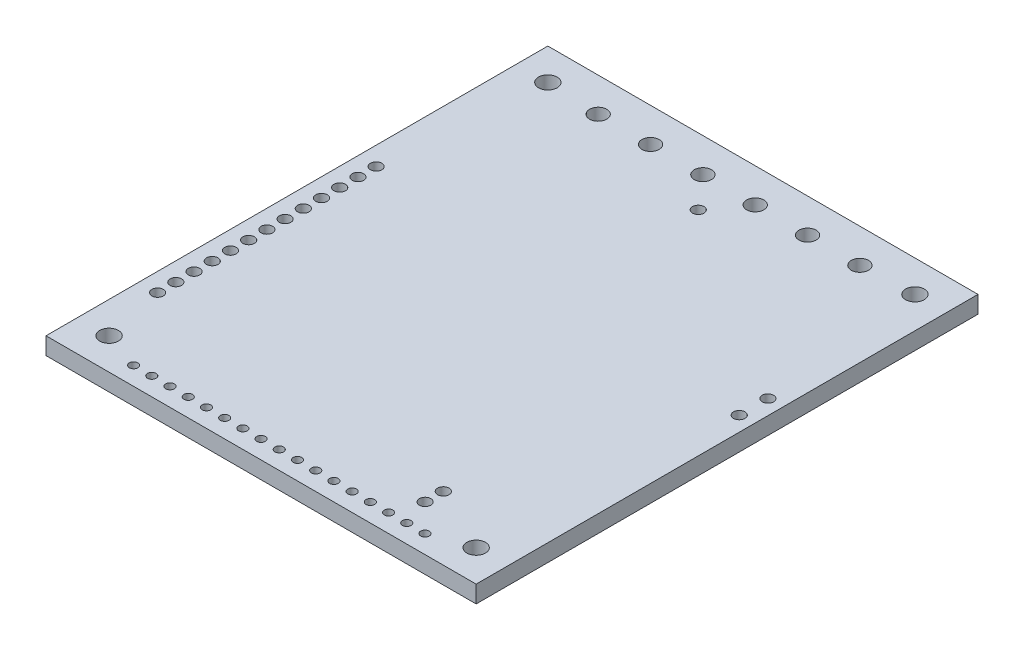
ISO-10303-21;
HEADER;
FILE_DESCRIPTION(('STEP AP214'),'2;1');
FILE_NAME('part.step','',(''),(''),'','','');
FILE_SCHEMA(('AUTOMOTIVE_DESIGN { 1 0 10303 214 1 1 1 1 }'));
ENDSEC;
DATA;
#1=APPLICATION_CONTEXT('core data for automotive mechanical design processes');
#2=APPLICATION_PROTOCOL_DEFINITION('international standard','automotive_design',2000,#1);
#3=PRODUCT_CONTEXT('',#1,'mechanical');
#4=PRODUCT('Part','Part','',(#3));
#5=PRODUCT_RELATED_PRODUCT_CATEGORY('part','',(#4));
#6=PRODUCT_DEFINITION_FORMATION('','',#4);
#7=PRODUCT_DEFINITION_CONTEXT('part definition',#1,'design');
#8=PRODUCT_DEFINITION('design','',#6,#7);
#9=PRODUCT_DEFINITION_SHAPE('','',#8);
#10=(LENGTH_UNIT() NAMED_UNIT(*) SI_UNIT(.MILLI.,.METRE.));
#11=(NAMED_UNIT(*) PLANE_ANGLE_UNIT() SI_UNIT($,.RADIAN.));
#12=(NAMED_UNIT(*) SI_UNIT($,.STERADIAN.) SOLID_ANGLE_UNIT());
#13=UNCERTAINTY_MEASURE_WITH_UNIT(LENGTH_MEASURE(1.E-05),#10,'distance_accuracy_value','');
#14=(GEOMETRIC_REPRESENTATION_CONTEXT(3) GLOBAL_UNCERTAINTY_ASSIGNED_CONTEXT((#13)) GLOBAL_UNIT_ASSIGNED_CONTEXT((#10,
#11,#12)) REPRESENTATION_CONTEXT('',''));
#15=CARTESIAN_POINT('',(0.,0.,0.));
#16=DIRECTION('',(0.,0.,1.));
#17=DIRECTION('',(1.,0.,0.));
#18=AXIS2_PLACEMENT_3D('',#15,#16,#17);
#19=CARTESIAN_POINT('',(-14.987397,0.,17.441037));
#20=DIRECTION('',(0.,1.,0.));
#21=DIRECTION('',(0.,0.,1.));
#22=AXIS2_PLACEMENT_3D('',#19,#20,#21);
#23=PLANE('',#22);
#24=DIRECTION('',(0.,0.,-1.));
#25=VECTOR('',#24,1.);
#26=CARTESIAN_POINT('',(15.012543,0.,-17.559147));
#27=LINE('',#26,#25);
#28=CARTESIAN_POINT('',(15.012543,0.,-17.559147));
#29=VERTEX_POINT('',#28);
#30=CARTESIAN_POINT('',(15.012543,0.,17.441037));
#31=VERTEX_POINT('',#30);
#32=EDGE_CURVE('E58',#29,#31,#27,.F.);
#33=ORIENTED_EDGE('',*,*,#32,.F.);
#34=DIRECTION('',(-1.,0.,0.));
#35=VECTOR('',#34,1.);
#36=CARTESIAN_POINT('',(-14.987397,0.,-17.559147));
#37=LINE('',#36,#35);
#38=CARTESIAN_POINT('',(-14.987397,0.,-17.559147));
#39=VERTEX_POINT('',#38);
#40=EDGE_CURVE('E53',#39,#29,#37,.F.);
#41=ORIENTED_EDGE('',*,*,#40,.F.);
#42=DIRECTION('',(0.,0.,1.));
#43=VECTOR('',#42,1.);
#44=CARTESIAN_POINT('',(-14.987397,0.,-17.559147));
#45=LINE('',#44,#43);
#46=CARTESIAN_POINT('',(-14.987397,0.,17.441037));
#47=VERTEX_POINT('',#46);
#48=EDGE_CURVE('E71',#47,#39,#45,.F.);
#49=ORIENTED_EDGE('',*,*,#48,.F.);
#50=DIRECTION('',(1.,0.,0.));
#51=VECTOR('',#50,1.);
#52=CARTESIAN_POINT('',(-14.987397,0.,17.441037));
#53=LINE('',#52,#51);
#54=EDGE_CURVE('E67',#31,#47,#53,.F.);
#55=ORIENTED_EDGE('',*,*,#54,.F.);
#56=EDGE_LOOP('',(#33,#41,#49,#55));
#57=FACE_BOUND('',#56,.T.);
#58=CARTESIAN_POINT('',(5.48875300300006,0.,-15.1951690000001));
#59=DIRECTION('',(0.,1.,0.));
#60=DIRECTION('',(0.,0.,1.));
#61=AXIS2_PLACEMENT_3D('',#58,#59,#60);
#62=CIRCLE('',#61,0.599999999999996);
#63=CARTESIAN_POINT('',(5.48875300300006,0.,-14.5951690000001));
#64=VERTEX_POINT('',#63);
#65=EDGE_CURVE('E75',#64,#64,#62,.F.);
#66=ORIENTED_EDGE('',*,*,#65,.T.);
#67=EDGE_LOOP('',(#66));
#68=FACE_BOUND('',#67,.T.);
#69=CARTESIAN_POINT('',(1.838773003,0.,-15.1951690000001));
#70=DIRECTION('',(0.,1.,0.));
#71=DIRECTION('',(0.,0.,1.));
#72=AXIS2_PLACEMENT_3D('',#69,#70,#71);
#73=CIRCLE('',#72,0.599999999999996);
#74=CARTESIAN_POINT('',(1.838773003,0.,-14.5951690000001));
#75=VERTEX_POINT('',#74);
#76=EDGE_CURVE('E222',#75,#75,#73,.F.);
#77=ORIENTED_EDGE('',*,*,#76,.T.);
#78=EDGE_LOOP('',(#77));
#79=FACE_BOUND('',#78,.T.);
#80=CARTESIAN_POINT('',(-1.81120699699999,-1.2490009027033E-13,-15.1951690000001));
#81=DIRECTION('',(0.,1.,0.));
#82=DIRECTION('',(0.,0.,1.));
#83=AXIS2_PLACEMENT_3D('',#80,#81,#82);
#84=CIRCLE('',#83,0.599999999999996);
#85=CARTESIAN_POINT('',(-1.81120699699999,-1.24828540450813E-13,-14.5951690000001));
#86=VERTEX_POINT('',#85);
#87=EDGE_CURVE('E225',#86,#86,#84,.F.);
#88=ORIENTED_EDGE('',*,*,#87,.T.);
#89=EDGE_LOOP('',(#88));
#90=FACE_BOUND('',#89,.T.);
#91=CARTESIAN_POINT('',(-5.46118699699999,0.,-15.1951690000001));
#92=DIRECTION('',(0.,1.,0.));
#93=DIRECTION('',(0.,0.,1.));
#94=AXIS2_PLACEMENT_3D('',#91,#92,#93);
#95=CIRCLE('',#94,0.599999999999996);
#96=CARTESIAN_POINT('',(-5.46118699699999,0.,-14.5951690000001));
#97=VERTEX_POINT('',#96);
#98=EDGE_CURVE('E228',#97,#97,#95,.F.);
#99=ORIENTED_EDGE('',*,*,#98,.T.);
#100=EDGE_LOOP('',(#99));
#101=FACE_BOUND('',#100,.T.);
#102=CARTESIAN_POINT('',(-9.11116699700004,0.,-15.1951690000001));
#103=DIRECTION('',(0.,1.,0.));
#104=DIRECTION('',(0.,0.,1.));
#105=AXIS2_PLACEMENT_3D('',#102,#103,#104);
#106=CIRCLE('',#105,0.599999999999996);
#107=CARTESIAN_POINT('',(-9.11116699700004,0.,-14.5951690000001));
#108=VERTEX_POINT('',#107);
#109=EDGE_CURVE('E231',#108,#108,#106,.F.);
#110=ORIENTED_EDGE('',*,*,#109,.T.);
#111=EDGE_LOOP('',(#110));
#112=FACE_BOUND('',#111,.T.);
#113=CARTESIAN_POINT('',(9.138733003,-1.2490009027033E-13,-15.1951690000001));
#114=DIRECTION('',(0.,1.,0.));
#115=DIRECTION('',(0.,0.,1.));
#116=AXIS2_PLACEMENT_3D('',#113,#114,#115);
#117=CIRCLE('',#116,0.599999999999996);
#118=CARTESIAN_POINT('',(9.138733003,-1.24828540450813E-13,-14.5951690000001));
#119=VERTEX_POINT('',#118);
#120=EDGE_CURVE('E234',#119,#119,#117,.F.);
#121=ORIENTED_EDGE('',*,*,#120,.T.);
#122=EDGE_LOOP('',(#121));
#123=FACE_BOUND('',#122,.T.);
#124=CARTESIAN_POINT('',(10.172573,-1.2490009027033E-13,16.171037));
#125=DIRECTION('',(0.,1.,0.));
#126=DIRECTION('',(0.,0.,1.));
#127=AXIS2_PLACEMENT_3D('',#124,#125,#126);
#128=CIRCLE('',#127,0.299999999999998);
#129=CARTESIAN_POINT('',(10.172573,-1.24864315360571E-13,16.471037));
#130=VERTEX_POINT('',#129);
#131=EDGE_CURVE('E237',#130,#130,#128,.F.);
#132=ORIENTED_EDGE('',*,*,#131,.T.);
#133=EDGE_LOOP('',(#132));
#134=FACE_BOUND('',#133,.T.);
#135=CARTESIAN_POINT('',(8.90257300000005,-1.2490009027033E-13,16.171037));
#136=DIRECTION('',(0.,1.,0.));
#137=DIRECTION('',(0.,0.,1.));
#138=AXIS2_PLACEMENT_3D('',#135,#136,#137);
#139=CIRCLE('',#138,0.299999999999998);
#140=CARTESIAN_POINT('',(8.90257300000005,-1.24864315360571E-13,16.471037));
#141=VERTEX_POINT('',#140);
#142=EDGE_CURVE('E240',#141,#141,#139,.F.);
#143=ORIENTED_EDGE('',*,*,#142,.T.);
#144=EDGE_LOOP('',(#143));
#145=FACE_BOUND('',#144,.T.);
#146=CARTESIAN_POINT('',(7.63257300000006,-1.2490009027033E-13,16.171037));
#147=DIRECTION('',(0.,1.,0.));
#148=DIRECTION('',(0.,0.,1.));
#149=AXIS2_PLACEMENT_3D('',#146,#147,#148);
#150=CIRCLE('',#149,0.299999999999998);
#151=CARTESIAN_POINT('',(7.63257300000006,-1.24864315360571E-13,16.471037));
#152=VERTEX_POINT('',#151);
#153=EDGE_CURVE('E243',#152,#152,#150,.F.);
#154=ORIENTED_EDGE('',*,*,#153,.T.);
#155=EDGE_LOOP('',(#154));
#156=FACE_BOUND('',#155,.T.);
#157=CARTESIAN_POINT('',(6.36257300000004,-1.2490009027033E-13,16.171037));
#158=DIRECTION('',(0.,1.,0.));
#159=DIRECTION('',(0.,0.,1.));
#160=AXIS2_PLACEMENT_3D('',#157,#158,#159);
#161=CIRCLE('',#160,0.299999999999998);
#162=CARTESIAN_POINT('',(6.36257300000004,-1.24864315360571E-13,16.471037));
#163=VERTEX_POINT('',#162);
#164=EDGE_CURVE('E246',#163,#163,#161,.F.);
#165=ORIENTED_EDGE('',*,*,#164,.T.);
#166=EDGE_LOOP('',(#165));
#167=FACE_BOUND('',#166,.T.);
#168=CARTESIAN_POINT('',(5.09257300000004,-1.2490009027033E-13,16.171037));
#169=DIRECTION('',(0.,1.,0.));
#170=DIRECTION('',(0.,0.,1.));
#171=AXIS2_PLACEMENT_3D('',#168,#169,#170);
#172=CIRCLE('',#171,0.299999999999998);
#173=CARTESIAN_POINT('',(5.09257300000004,-1.24864315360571E-13,16.471037));
#174=VERTEX_POINT('',#173);
#175=EDGE_CURVE('E249',#174,#174,#172,.F.);
#176=ORIENTED_EDGE('',*,*,#175,.T.);
#177=EDGE_LOOP('',(#176));
#178=FACE_BOUND('',#177,.T.);
#179=CARTESIAN_POINT('',(3.82257300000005,-1.2490009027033E-13,16.171037));
#180=DIRECTION('',(0.,1.,0.));
#181=DIRECTION('',(0.,0.,1.));
#182=AXIS2_PLACEMENT_3D('',#179,#180,#181);
#183=CIRCLE('',#182,0.299999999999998);
#184=CARTESIAN_POINT('',(3.82257300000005,-1.24864315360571E-13,16.471037));
#185=VERTEX_POINT('',#184);
#186=EDGE_CURVE('E252',#185,#185,#183,.F.);
#187=ORIENTED_EDGE('',*,*,#186,.T.);
#188=EDGE_LOOP('',(#187));
#189=FACE_BOUND('',#188,.T.);
#190=CARTESIAN_POINT('',(2.55257300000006,-1.2490009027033E-13,16.171037));
#191=DIRECTION('',(0.,1.,0.));
#192=DIRECTION('',(0.,0.,1.));
#193=AXIS2_PLACEMENT_3D('',#190,#191,#192);
#194=CIRCLE('',#193,0.299999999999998);
#195=CARTESIAN_POINT('',(2.55257300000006,-1.24864315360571E-13,16.471037));
#196=VERTEX_POINT('',#195);
#197=EDGE_CURVE('E255',#196,#196,#194,.F.);
#198=ORIENTED_EDGE('',*,*,#197,.T.);
#199=EDGE_LOOP('',(#198));
#200=FACE_BOUND('',#199,.T.);
#201=CARTESIAN_POINT('',(1.28257300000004,0.,16.171037));
#202=DIRECTION('',(0.,1.,0.));
#203=DIRECTION('',(0.,0.,1.));
#204=AXIS2_PLACEMENT_3D('',#201,#202,#203);
#205=CIRCLE('',#204,0.299999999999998);
#206=CARTESIAN_POINT('',(1.28257300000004,0.,16.471037));
#207=VERTEX_POINT('',#206);
#208=EDGE_CURVE('E258',#207,#207,#205,.F.);
#209=ORIENTED_EDGE('',*,*,#208,.T.);
#210=EDGE_LOOP('',(#209));
#211=FACE_BOUND('',#210,.T.);
#212=CARTESIAN_POINT('',(0.0125730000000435,0.,16.171037));
#213=DIRECTION('',(0.,1.,0.));
#214=DIRECTION('',(0.,0.,1.));
#215=AXIS2_PLACEMENT_3D('',#212,#213,#214);
#216=CIRCLE('',#215,0.299999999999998);
#217=CARTESIAN_POINT('',(0.0125730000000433,0.,16.471037));
#218=VERTEX_POINT('',#217);
#219=EDGE_CURVE('E261',#218,#218,#216,.F.);
#220=ORIENTED_EDGE('',*,*,#219,.T.);
#221=EDGE_LOOP('',(#220));
#222=FACE_BOUND('',#221,.T.);
#223=CARTESIAN_POINT('',(-1.25742699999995,-1.2490009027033E-13,16.171037));
#224=DIRECTION('',(0.,1.,0.));
#225=DIRECTION('',(0.,0.,1.));
#226=AXIS2_PLACEMENT_3D('',#223,#224,#225);
#227=CIRCLE('',#226,0.299999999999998);
#228=CARTESIAN_POINT('',(-1.25742699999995,-1.24864315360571E-13,16.471037));
#229=VERTEX_POINT('',#228);
#230=EDGE_CURVE('E264',#229,#229,#227,.F.);
#231=ORIENTED_EDGE('',*,*,#230,.T.);
#232=EDGE_LOOP('',(#231));
#233=FACE_BOUND('',#232,.T.);
#234=CARTESIAN_POINT('',(-2.52742699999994,-1.2490009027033E-13,16.171037));
#235=DIRECTION('',(0.,1.,0.));
#236=DIRECTION('',(0.,0.,1.));
#237=AXIS2_PLACEMENT_3D('',#234,#235,#236);
#238=CIRCLE('',#237,0.299999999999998);
#239=CARTESIAN_POINT('',(-2.52742699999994,-1.24864315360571E-13,16.471037));
#240=VERTEX_POINT('',#239);
#241=EDGE_CURVE('E267',#240,#240,#238,.F.);
#242=ORIENTED_EDGE('',*,*,#241,.T.);
#243=EDGE_LOOP('',(#242));
#244=FACE_BOUND('',#243,.T.);
#245=CARTESIAN_POINT('',(-3.79742699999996,-1.2490009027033E-13,16.171037));
#246=DIRECTION('',(0.,1.,0.));
#247=DIRECTION('',(0.,0.,1.));
#248=AXIS2_PLACEMENT_3D('',#245,#246,#247);
#249=CIRCLE('',#248,0.299999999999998);
#250=CARTESIAN_POINT('',(-3.79742699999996,-1.24864315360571E-13,16.471037));
#251=VERTEX_POINT('',#250);
#252=EDGE_CURVE('E270',#251,#251,#249,.F.);
#253=ORIENTED_EDGE('',*,*,#252,.T.);
#254=EDGE_LOOP('',(#253));
#255=FACE_BOUND('',#254,.T.);
#256=CARTESIAN_POINT('',(-5.06742699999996,-1.2490009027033E-13,16.171037));
#257=DIRECTION('',(0.,1.,0.));
#258=DIRECTION('',(0.,0.,1.));
#259=AXIS2_PLACEMENT_3D('',#256,#257,#258);
#260=CIRCLE('',#259,0.299999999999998);
#261=CARTESIAN_POINT('',(-5.06742699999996,-1.24864315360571E-13,16.471037));
#262=VERTEX_POINT('',#261);
#263=EDGE_CURVE('E273',#262,#262,#260,.F.);
#264=ORIENTED_EDGE('',*,*,#263,.T.);
#265=EDGE_LOOP('',(#264));
#266=FACE_BOUND('',#265,.T.);
#267=CARTESIAN_POINT('',(-6.33742699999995,-1.2490009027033E-13,16.171037));
#268=DIRECTION('',(0.,1.,0.));
#269=DIRECTION('',(0.,0.,1.));
#270=AXIS2_PLACEMENT_3D('',#267,#268,#269);
#271=CIRCLE('',#270,0.299999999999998);
#272=CARTESIAN_POINT('',(-6.33742699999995,-1.24864315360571E-13,16.471037));
#273=VERTEX_POINT('',#272);
#274=EDGE_CURVE('E276',#273,#273,#271,.F.);
#275=ORIENTED_EDGE('',*,*,#274,.T.);
#276=EDGE_LOOP('',(#275));
#277=FACE_BOUND('',#276,.T.);
#278=CARTESIAN_POINT('',(-7.60742699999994,0.,16.171037));
#279=DIRECTION('',(0.,1.,0.));
#280=DIRECTION('',(0.,0.,1.));
#281=AXIS2_PLACEMENT_3D('',#278,#279,#280);
#282=CIRCLE('',#281,0.299999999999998);
#283=CARTESIAN_POINT('',(-7.60742699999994,0.,16.471037));
#284=VERTEX_POINT('',#283);
#285=EDGE_CURVE('E279',#284,#284,#282,.F.);
#286=ORIENTED_EDGE('',*,*,#285,.T.);
#287=EDGE_LOOP('',(#286));
#288=FACE_BOUND('',#287,.T.);
#289=CARTESIAN_POINT('',(-8.87742699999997,0.,16.171037));
#290=DIRECTION('',(0.,1.,0.));
#291=DIRECTION('',(0.,0.,1.));
#292=AXIS2_PLACEMENT_3D('',#289,#290,#291);
#293=CIRCLE('',#292,0.299999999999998);
#294=CARTESIAN_POINT('',(-8.87742699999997,0.,16.471037));
#295=VERTEX_POINT('',#294);
#296=EDGE_CURVE('E282',#295,#295,#293,.F.);
#297=ORIENTED_EDGE('',*,*,#296,.T.);
#298=EDGE_LOOP('',(#297));
#299=FACE_BOUND('',#298,.T.);
#300=CARTESIAN_POINT('',(-10.147427,0.,16.171037));
#301=DIRECTION('',(0.,1.,0.));
#302=DIRECTION('',(0.,0.,1.));
#303=AXIS2_PLACEMENT_3D('',#300,#301,#302);
#304=CIRCLE('',#303,0.299999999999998);
#305=CARTESIAN_POINT('',(-10.147427,0.,16.471037));
#306=VERTEX_POINT('',#305);
#307=EDGE_CURVE('E285',#306,#306,#304,.F.);
#308=ORIENTED_EDGE('',*,*,#307,.T.);
#309=EDGE_LOOP('',(#308));
#310=FACE_BOUND('',#309,.T.);
#311=CARTESIAN_POINT('',(12.81254300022,0.,-15.35896299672));
#312=DIRECTION('',(0.,1.,0.));
#313=DIRECTION('',(0.,0.,1.));
#314=AXIS2_PLACEMENT_3D('',#311,#312,#313);
#315=CIRCLE('',#314,0.65);
#316=CARTESIAN_POINT('',(12.81254300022,0.,-14.70896299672));
#317=VERTEX_POINT('',#316);
#318=EDGE_CURVE('E288',#317,#317,#315,.F.);
#319=ORIENTED_EDGE('',*,*,#318,.T.);
#320=EDGE_LOOP('',(#319));
#321=FACE_BOUND('',#320,.T.);
#322=CARTESIAN_POINT('',(-12.78745699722,0.,-15.35896299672));
#323=DIRECTION('',(0.,1.,0.));
#324=DIRECTION('',(0.,0.,1.));
#325=AXIS2_PLACEMENT_3D('',#322,#323,#324);
#326=CIRCLE('',#325,0.65);
#327=CARTESIAN_POINT('',(-12.78745699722,0.,-14.70896299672));
#328=VERTEX_POINT('',#327);
#329=EDGE_CURVE('E291',#328,#328,#326,.F.);
#330=ORIENTED_EDGE('',*,*,#329,.T.);
#331=EDGE_LOOP('',(#330));
#332=FACE_BOUND('',#331,.T.);
#333=CARTESIAN_POINT('',(-12.78745699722,-1.2490009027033E-13,15.24103700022));
#334=DIRECTION('',(0.,1.,0.));
#335=DIRECTION('',(0.,0.,1.));
#336=AXIS2_PLACEMENT_3D('',#333,#334,#335);
#337=CIRCLE('',#336,0.65);
#338=CARTESIAN_POINT('',(-12.78745699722,-1.24822577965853E-13,15.89103700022));
#339=VERTEX_POINT('',#338);
#340=EDGE_CURVE('E294',#339,#339,#337,.F.);
#341=ORIENTED_EDGE('',*,*,#340,.T.);
#342=EDGE_LOOP('',(#341));
#343=FACE_BOUND('',#342,.T.);
#344=CARTESIAN_POINT('',(12.81254300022,-1.2490009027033E-13,15.24103700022));
#345=DIRECTION('',(0.,1.,0.));
#346=DIRECTION('',(0.,0.,1.));
#347=AXIS2_PLACEMENT_3D('',#344,#345,#346);
#348=CIRCLE('',#347,0.65);
#349=CARTESIAN_POINT('',(12.81254300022,-1.24822577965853E-13,15.89103700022));
#350=VERTEX_POINT('',#349);
#351=EDGE_CURVE('E297',#350,#350,#348,.F.);
#352=ORIENTED_EDGE('',*,*,#351,.T.);
#353=EDGE_LOOP('',(#352));
#354=FACE_BOUND('',#353,.T.);
#355=CARTESIAN_POINT('',(13.9787630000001,0.,-1.94068699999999));
#356=DIRECTION('',(0.,1.,0.));
#357=DIRECTION('',(0.,0.,1.));
#358=AXIS2_PLACEMENT_3D('',#355,#356,#357);
#359=CIRCLE('',#358,0.399999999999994);
#360=CARTESIAN_POINT('',(13.9787630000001,0.,-1.54068699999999));
#361=VERTEX_POINT('',#360);
#362=EDGE_CURVE('E300',#361,#361,#359,.F.);
#363=ORIENTED_EDGE('',*,*,#362,.T.);
#364=EDGE_LOOP('',(#363));
#365=FACE_BOUND('',#364,.T.);
#366=CARTESIAN_POINT('',(13.9787630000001,-1.2490009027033E-13,-3.94068299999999));
#367=DIRECTION('',(0.,1.,0.));
#368=DIRECTION('',(0.,0.,1.));
#369=AXIS2_PLACEMENT_3D('',#366,#367,#368);
#370=CIRCLE('',#369,0.399999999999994);
#371=CARTESIAN_POINT('',(13.9787630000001,-1.24852390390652E-13,-3.54068299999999));
#372=VERTEX_POINT('',#371);
#373=EDGE_CURVE('E303',#372,#372,#370,.F.);
#374=ORIENTED_EDGE('',*,*,#373,.T.);
#375=EDGE_LOOP('',(#374));
#376=FACE_BOUND('',#375,.T.);
#377=CARTESIAN_POINT('',(-13.698347,-1.2490009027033E-13,-4.29501299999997));
#378=DIRECTION('',(0.,1.,0.));
#379=DIRECTION('',(0.,0.,1.));
#380=AXIS2_PLACEMENT_3D('',#377,#378,#379);
#381=CIRCLE('',#380,0.4);
#382=CARTESIAN_POINT('',(-13.698347,-1.24852390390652E-13,-3.89501299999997));
#383=VERTEX_POINT('',#382);
#384=EDGE_CURVE('E306',#383,#383,#381,.F.);
#385=ORIENTED_EDGE('',*,*,#384,.T.);
#386=EDGE_LOOP('',(#385));
#387=FACE_BOUND('',#386,.T.);
#388=CARTESIAN_POINT('',(-13.698347,0.,-3.02501299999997));
#389=DIRECTION('',(0.,1.,0.));
#390=DIRECTION('',(0.,0.,1.));
#391=AXIS2_PLACEMENT_3D('',#388,#389,#390);
#392=CIRCLE('',#391,0.4);
#393=CARTESIAN_POINT('',(-13.698347,0.,-2.62501299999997));
#394=VERTEX_POINT('',#393);
#395=EDGE_CURVE('E309',#394,#394,#392,.F.);
#396=ORIENTED_EDGE('',*,*,#395,.T.);
#397=EDGE_LOOP('',(#396));
#398=FACE_BOUND('',#397,.T.);
#399=CARTESIAN_POINT('',(-13.6983469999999,0.,-1.75501299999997));
#400=DIRECTION('',(0.,1.,0.));
#401=DIRECTION('',(0.,0.,1.));
#402=AXIS2_PLACEMENT_3D('',#399,#400,#401);
#403=CIRCLE('',#402,0.4);
#404=CARTESIAN_POINT('',(-13.6983469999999,0.,-1.35501299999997));
#405=VERTEX_POINT('',#404);
#406=EDGE_CURVE('E312',#405,#405,#403,.F.);
#407=ORIENTED_EDGE('',*,*,#406,.T.);
#408=EDGE_LOOP('',(#407));
#409=FACE_BOUND('',#408,.T.);
#410=CARTESIAN_POINT('',(-13.6983469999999,0.,-0.485012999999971));
#411=DIRECTION('',(0.,1.,0.));
#412=DIRECTION('',(0.,0.,1.));
#413=AXIS2_PLACEMENT_3D('',#410,#411,#412);
#414=CIRCLE('',#413,0.4);
#415=CARTESIAN_POINT('',(-13.6983469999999,0.,-0.0850129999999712));
#416=VERTEX_POINT('',#415);
#417=EDGE_CURVE('E315',#416,#416,#414,.F.);
#418=ORIENTED_EDGE('',*,*,#417,.T.);
#419=EDGE_LOOP('',(#418));
#420=FACE_BOUND('',#419,.T.);
#421=CARTESIAN_POINT('',(-13.6983469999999,-1.2490009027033E-13,0.78498700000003));
#422=DIRECTION('',(0.,1.,0.));
#423=DIRECTION('',(0.,0.,1.));
#424=AXIS2_PLACEMENT_3D('',#421,#422,#423);
#425=CIRCLE('',#424,0.4);
#426=CARTESIAN_POINT('',(-13.6983469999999,-1.24852390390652E-13,1.18498700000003));
#427=VERTEX_POINT('',#426);
#428=EDGE_CURVE('E318',#427,#427,#425,.F.);
#429=ORIENTED_EDGE('',*,*,#428,.T.);
#430=EDGE_LOOP('',(#429));
#431=FACE_BOUND('',#430,.T.);
#432=CARTESIAN_POINT('',(-13.6983469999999,-1.2490009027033E-13,2.05498700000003));
#433=DIRECTION('',(0.,1.,0.));
#434=DIRECTION('',(0.,0.,1.));
#435=AXIS2_PLACEMENT_3D('',#432,#433,#434);
#436=CIRCLE('',#435,0.4);
#437=CARTESIAN_POINT('',(-13.6983469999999,-1.24852390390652E-13,2.45498700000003));
#438=VERTEX_POINT('',#437);
#439=EDGE_CURVE('E321',#438,#438,#436,.F.);
#440=ORIENTED_EDGE('',*,*,#439,.T.);
#441=EDGE_LOOP('',(#440));
#442=FACE_BOUND('',#441,.T.);
#443=CARTESIAN_POINT('',(-13.6983469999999,0.,3.32498700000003));
#444=DIRECTION('',(0.,1.,0.));
#445=DIRECTION('',(0.,0.,1.));
#446=AXIS2_PLACEMENT_3D('',#443,#444,#445);
#447=CIRCLE('',#446,0.4);
#448=CARTESIAN_POINT('',(-13.6983469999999,0.,3.72498700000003));
#449=VERTEX_POINT('',#448);
#450=EDGE_CURVE('E324',#449,#449,#447,.F.);
#451=ORIENTED_EDGE('',*,*,#450,.T.);
#452=EDGE_LOOP('',(#451));
#453=FACE_BOUND('',#452,.T.);
#454=CARTESIAN_POINT('',(-13.6983469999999,0.,4.59498700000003));
#455=DIRECTION('',(0.,1.,0.));
#456=DIRECTION('',(0.,0.,1.));
#457=AXIS2_PLACEMENT_3D('',#454,#455,#456);
#458=CIRCLE('',#457,0.399999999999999);
#459=CARTESIAN_POINT('',(-13.6983469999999,0.,4.99498700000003));
#460=VERTEX_POINT('',#459);
#461=EDGE_CURVE('E327',#460,#460,#458,.F.);
#462=ORIENTED_EDGE('',*,*,#461,.T.);
#463=EDGE_LOOP('',(#462));
#464=FACE_BOUND('',#463,.T.);
#465=CARTESIAN_POINT('',(-13.6983469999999,0.,5.86498700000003));
#466=DIRECTION('',(0.,1.,0.));
#467=DIRECTION('',(0.,0.,1.));
#468=AXIS2_PLACEMENT_3D('',#465,#466,#467);
#469=CIRCLE('',#468,0.399999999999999);
#470=CARTESIAN_POINT('',(-13.6983469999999,0.,6.26498700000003));
#471=VERTEX_POINT('',#470);
#472=EDGE_CURVE('E330',#471,#471,#469,.F.);
#473=ORIENTED_EDGE('',*,*,#472,.T.);
#474=EDGE_LOOP('',(#473));
#475=FACE_BOUND('',#474,.T.);
#476=CARTESIAN_POINT('',(-13.6983469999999,0.,7.13498700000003));
#477=DIRECTION('',(0.,1.,0.));
#478=DIRECTION('',(0.,0.,1.));
#479=AXIS2_PLACEMENT_3D('',#476,#477,#478);
#480=CIRCLE('',#479,0.399999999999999);
#481=CARTESIAN_POINT('',(-13.6983469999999,0.,7.53498700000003));
#482=VERTEX_POINT('',#481);
#483=EDGE_CURVE('E333',#482,#482,#480,.F.);
#484=ORIENTED_EDGE('',*,*,#483,.T.);
#485=EDGE_LOOP('',(#484));
#486=FACE_BOUND('',#485,.T.);
#487=CARTESIAN_POINT('',(-13.6983469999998,-1.2490009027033E-13,8.40498700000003));
#488=DIRECTION('',(0.,1.,0.));
#489=DIRECTION('',(0.,0.,1.));
#490=AXIS2_PLACEMENT_3D('',#487,#488,#489);
#491=CIRCLE('',#490,0.399999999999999);
#492=CARTESIAN_POINT('',(-13.6983469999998,-1.24852390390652E-13,8.80498700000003));
#493=VERTEX_POINT('',#492);
#494=EDGE_CURVE('E336',#493,#493,#491,.F.);
#495=ORIENTED_EDGE('',*,*,#494,.T.);
#496=EDGE_LOOP('',(#495));
#497=FACE_BOUND('',#496,.T.);
#498=CARTESIAN_POINT('',(-13.6983469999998,-1.2490009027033E-13,9.67498700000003));
#499=DIRECTION('',(0.,1.,0.));
#500=DIRECTION('',(0.,0.,1.));
#501=AXIS2_PLACEMENT_3D('',#498,#499,#500);
#502=CIRCLE('',#501,0.399999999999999);
#503=CARTESIAN_POINT('',(-13.6983469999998,-1.24852390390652E-13,10.074987));
#504=VERTEX_POINT('',#503);
#505=EDGE_CURVE('E339',#504,#504,#502,.F.);
#506=ORIENTED_EDGE('',*,*,#505,.T.);
#507=EDGE_LOOP('',(#506));
#508=FACE_BOUND('',#507,.T.);
#509=CARTESIAN_POINT('',(-13.6983469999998,0.,10.944987));
#510=DIRECTION('',(0.,1.,0.));
#511=DIRECTION('',(0.,0.,1.));
#512=AXIS2_PLACEMENT_3D('',#509,#510,#511);
#513=CIRCLE('',#512,0.399999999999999);
#514=CARTESIAN_POINT('',(-13.6983469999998,0.,11.344987));
#515=VERTEX_POINT('',#514);
#516=EDGE_CURVE('E342',#515,#515,#513,.F.);
#517=ORIENTED_EDGE('',*,*,#516,.T.);
#518=EDGE_LOOP('',(#517));
#519=FACE_BOUND('',#518,.T.);
#520=CARTESIAN_POINT('',(8.26763300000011,-1.2490009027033E-13,12.9858769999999));
#521=DIRECTION('',(0.,1.,0.));
#522=DIRECTION('',(0.,0.,1.));
#523=AXIS2_PLACEMENT_3D('',#520,#521,#522);
#524=CIRCLE('',#523,0.400000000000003);
#525=CARTESIAN_POINT('',(8.26763300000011,-1.24852390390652E-13,13.3858769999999));
#526=VERTEX_POINT('',#525);
#527=EDGE_CURVE('E345',#526,#526,#524,.F.);
#528=ORIENTED_EDGE('',*,*,#527,.T.);
#529=EDGE_LOOP('',(#528));
#530=FACE_BOUND('',#529,.T.);
#531=CARTESIAN_POINT('',(8.26763300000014,-1.2490009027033E-13,14.2558769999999));
#532=DIRECTION('',(0.,1.,0.));
#533=DIRECTION('',(0.,0.,1.));
#534=AXIS2_PLACEMENT_3D('',#531,#532,#533);
#535=CIRCLE('',#534,0.400000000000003);
#536=CARTESIAN_POINT('',(8.26763300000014,-1.24852390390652E-13,14.6558769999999));
#537=VERTEX_POINT('',#536);
#538=EDGE_CURVE('E347',#537,#537,#535,.F.);
#539=ORIENTED_EDGE('',*,*,#538,.T.);
#540=EDGE_LOOP('',(#539));
#541=FACE_BOUND('',#540,.T.);
#542=CARTESIAN_POINT('',(0.153543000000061,0.,-12.909169));
#543=DIRECTION('',(0.,1.,0.));
#544=DIRECTION('',(0.,0.,1.));
#545=AXIS2_PLACEMENT_3D('',#542,#543,#544);
#546=CIRCLE('',#545,0.400000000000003);
#547=CARTESIAN_POINT('',(0.153543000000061,0.,-12.509169));
#548=VERTEX_POINT('',#547);
#549=EDGE_CURVE('E20',#548,#548,#546,.F.);
#550=ORIENTED_EDGE('',*,*,#549,.T.);
#551=EDGE_LOOP('',(#550));
#552=FACE_BOUND('',#551,.T.);
#553=ADVANCED_FACE('F17',(#57,#68,#79,#90,#101,#112,#123,#134,#145,#156,#167,#178,#189,#200,
#211,#222,#233,#244,#255,#266,#277,#288,#299,#310,#321,#332,#343,#354,#365,#376,#387,#398,#409,
#420,#431,#442,#453,#464,#475,#486,#497,#508,#519,#530,#541,#552),#23,.T.);
#554=CARTESIAN_POINT('',(0.153543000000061,-1.20000000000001,-12.909169));
#555=DIRECTION('',(0.,1.,0.));
#556=DIRECTION('',(0.,0.,1.));
#557=AXIS2_PLACEMENT_3D('',#554,#555,#556);
#558=CYLINDRICAL_SURFACE('',#557,0.400000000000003);
#559=ORIENTED_EDGE('',*,*,#549,.F.);
#560=EDGE_LOOP('',(#559));
#561=FACE_BOUND('',#560,.T.);
#562=CARTESIAN_POINT('',(0.153543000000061,-1.20000000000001,-12.909169));
#563=DIRECTION('',(0.,1.,0.));
#564=DIRECTION('',(0.,0.,1.));
#565=AXIS2_PLACEMENT_3D('',#562,#563,#564);
#566=CIRCLE('',#565,0.400000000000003);
#567=CARTESIAN_POINT('',(0.153543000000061,-1.20000000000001,-12.509169));
#568=VERTEX_POINT('',#567);
#569=EDGE_CURVE('E216',#568,#568,#566,.F.);
#570=ORIENTED_EDGE('',*,*,#569,.T.);
#571=EDGE_LOOP('',(#570));
#572=FACE_BOUND('',#571,.T.);
#573=ADVANCED_FACE('F355',(#561,#572),#558,.F.);
#574=CARTESIAN_POINT('',(8.26763300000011,-1.20000000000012,14.2558769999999));
#575=DIRECTION('',(0.,1.,0.));
#576=DIRECTION('',(0.,0.,1.));
#577=AXIS2_PLACEMENT_3D('',#574,#575,#576);
#578=CYLINDRICAL_SURFACE('',#577,0.400000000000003);
#579=ORIENTED_EDGE('',*,*,#538,.F.);
#580=EDGE_LOOP('',(#579));
#581=FACE_BOUND('',#580,.T.);
#582=CARTESIAN_POINT('',(8.26763300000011,-1.20000000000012,14.2558769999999));
#583=DIRECTION('',(0.,1.,0.));
#584=DIRECTION('',(0.,0.,1.));
#585=AXIS2_PLACEMENT_3D('',#582,#583,#584);
#586=CIRCLE('',#585,0.400000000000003);
#587=CARTESIAN_POINT('',(8.26763300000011,-1.20000000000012,14.6558769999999));
#588=VERTEX_POINT('',#587);
#589=EDGE_CURVE('E213',#588,#588,#586,.F.);
#590=ORIENTED_EDGE('',*,*,#589,.T.);
#591=EDGE_LOOP('',(#590));
#592=FACE_BOUND('',#591,.T.);
#593=ADVANCED_FACE('F358',(#581,#592),#578,.F.);
#594=CARTESIAN_POINT('',(8.26763300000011,-1.20000000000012,12.9858769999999));
#595=DIRECTION('',(0.,1.,0.));
#596=DIRECTION('',(0.,0.,1.));
#597=AXIS2_PLACEMENT_3D('',#594,#595,#596);
#598=CYLINDRICAL_SURFACE('',#597,0.400000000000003);
#599=ORIENTED_EDGE('',*,*,#527,.F.);
#600=EDGE_LOOP('',(#599));
#601=FACE_BOUND('',#600,.T.);
#602=CARTESIAN_POINT('',(8.26763300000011,-1.20000000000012,12.9858769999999));
#603=DIRECTION('',(0.,1.,0.));
#604=DIRECTION('',(0.,0.,1.));
#605=AXIS2_PLACEMENT_3D('',#602,#603,#604);
#606=CIRCLE('',#605,0.400000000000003);
#607=CARTESIAN_POINT('',(8.26763300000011,-1.20000000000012,13.3858769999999));
#608=VERTEX_POINT('',#607);
#609=EDGE_CURVE('E210',#608,#608,#606,.F.);
#610=ORIENTED_EDGE('',*,*,#609,.T.);
#611=EDGE_LOOP('',(#610));
#612=FACE_BOUND('',#611,.T.);
#613=ADVANCED_FACE('F548',(#601,#612),#598,.F.);
#614=CARTESIAN_POINT('',(-13.6983469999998,-2.,10.944987));
#615=DIRECTION('',(0.,1.,0.));
#616=DIRECTION('',(0.,0.,1.));
#617=AXIS2_PLACEMENT_3D('',#614,#615,#616);
#618=CYLINDRICAL_SURFACE('',#617,0.399999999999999);
#619=CARTESIAN_POINT('',(-13.6983469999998,-1.20000000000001,10.944987));
#620=DIRECTION('',(0.,1.,0.));
#621=DIRECTION('',(0.,0.,1.));
#622=AXIS2_PLACEMENT_3D('',#619,#620,#621);
#623=CIRCLE('',#622,0.399999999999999);
#624=CARTESIAN_POINT('',(-13.6983469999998,-1.20000000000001,11.344987));
#625=VERTEX_POINT('',#624);
#626=EDGE_CURVE('E207',#625,#625,#623,.F.);
#627=ORIENTED_EDGE('',*,*,#626,.T.);
#628=EDGE_LOOP('',(#627));
#629=FACE_BOUND('',#628,.T.);
#630=ORIENTED_EDGE('',*,*,#516,.F.);
#631=EDGE_LOOP('',(#630));
#632=FACE_BOUND('',#631,.T.);
#633=ADVANCED_FACE('F544',(#629,#632),#618,.F.);
#634=CARTESIAN_POINT('',(-13.6983469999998,-2.00000000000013,9.67498700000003));
#635=DIRECTION('',(0.,1.,0.));
#636=DIRECTION('',(0.,0.,1.));
#637=AXIS2_PLACEMENT_3D('',#634,#635,#636);
#638=CYLINDRICAL_SURFACE('',#637,0.399999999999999);
#639=CARTESIAN_POINT('',(-13.6983469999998,-1.20000000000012,9.67498700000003));
#640=DIRECTION('',(0.,1.,0.));
#641=DIRECTION('',(0.,0.,1.));
#642=AXIS2_PLACEMENT_3D('',#639,#640,#641);
#643=CIRCLE('',#642,0.399999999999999);
#644=CARTESIAN_POINT('',(-13.6983469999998,-1.20000000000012,10.074987));
#645=VERTEX_POINT('',#644);
#646=EDGE_CURVE('E204',#645,#645,#643,.F.);
#647=ORIENTED_EDGE('',*,*,#646,.T.);
#648=EDGE_LOOP('',(#647));
#649=FACE_BOUND('',#648,.T.);
#650=ORIENTED_EDGE('',*,*,#505,.F.);
#651=EDGE_LOOP('',(#650));
#652=FACE_BOUND('',#651,.T.);
#653=ADVANCED_FACE('F540',(#649,#652),#638,.F.);
#654=CARTESIAN_POINT('',(-13.6983469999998,-2.00000000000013,8.40498700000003));
#655=DIRECTION('',(0.,1.,0.));
#656=DIRECTION('',(0.,0.,1.));
#657=AXIS2_PLACEMENT_3D('',#654,#655,#656);
#658=CYLINDRICAL_SURFACE('',#657,0.399999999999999);
#659=CARTESIAN_POINT('',(-13.6983469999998,-1.20000000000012,8.40498700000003));
#660=DIRECTION('',(0.,1.,0.));
#661=DIRECTION('',(0.,0.,1.));
#662=AXIS2_PLACEMENT_3D('',#659,#660,#661);
#663=CIRCLE('',#662,0.399999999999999);
#664=CARTESIAN_POINT('',(-13.6983469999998,-1.20000000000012,8.80498700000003));
#665=VERTEX_POINT('',#664);
#666=EDGE_CURVE('E201',#665,#665,#663,.F.);
#667=ORIENTED_EDGE('',*,*,#666,.T.);
#668=EDGE_LOOP('',(#667));
#669=FACE_BOUND('',#668,.T.);
#670=ORIENTED_EDGE('',*,*,#494,.F.);
#671=EDGE_LOOP('',(#670));
#672=FACE_BOUND('',#671,.T.);
#673=ADVANCED_FACE('F536',(#669,#672),#658,.F.);
#674=CARTESIAN_POINT('',(-13.6983469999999,-2.,7.13498700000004));
#675=DIRECTION('',(0.,1.,0.));
#676=DIRECTION('',(0.,0.,1.));
#677=AXIS2_PLACEMENT_3D('',#674,#675,#676);
#678=CYLINDRICAL_SURFACE('',#677,0.399999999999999);
#679=CARTESIAN_POINT('',(-13.6983469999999,-1.20000000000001,7.13498700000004));
#680=DIRECTION('',(0.,1.,0.));
#681=DIRECTION('',(0.,0.,1.));
#682=AXIS2_PLACEMENT_3D('',#679,#680,#681);
#683=CIRCLE('',#682,0.399999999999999);
#684=CARTESIAN_POINT('',(-13.6983469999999,-1.20000000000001,7.53498700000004));
#685=VERTEX_POINT('',#684);
#686=EDGE_CURVE('E198',#685,#685,#683,.F.);
#687=ORIENTED_EDGE('',*,*,#686,.T.);
#688=EDGE_LOOP('',(#687));
#689=FACE_BOUND('',#688,.T.);
#690=ORIENTED_EDGE('',*,*,#483,.F.);
#691=EDGE_LOOP('',(#690));
#692=FACE_BOUND('',#691,.T.);
#693=ADVANCED_FACE('F532',(#689,#692),#678,.F.);
#694=CARTESIAN_POINT('',(-13.6983469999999,-2.,5.86498700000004));
#695=DIRECTION('',(0.,1.,0.));
#696=DIRECTION('',(0.,0.,1.));
#697=AXIS2_PLACEMENT_3D('',#694,#695,#696);
#698=CYLINDRICAL_SURFACE('',#697,0.399999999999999);
#699=CARTESIAN_POINT('',(-13.6983469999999,-1.20000000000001,5.86498700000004));
#700=DIRECTION('',(0.,1.,0.));
#701=DIRECTION('',(0.,0.,1.));
#702=AXIS2_PLACEMENT_3D('',#699,#700,#701);
#703=CIRCLE('',#702,0.399999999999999);
#704=CARTESIAN_POINT('',(-13.6983469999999,-1.20000000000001,6.26498700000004));
#705=VERTEX_POINT('',#704);
#706=EDGE_CURVE('E195',#705,#705,#703,.F.);
#707=ORIENTED_EDGE('',*,*,#706,.T.);
#708=EDGE_LOOP('',(#707));
#709=FACE_BOUND('',#708,.T.);
#710=ORIENTED_EDGE('',*,*,#472,.F.);
#711=EDGE_LOOP('',(#710));
#712=FACE_BOUND('',#711,.T.);
#713=ADVANCED_FACE('F528',(#709,#712),#698,.F.);
#714=CARTESIAN_POINT('',(-13.6983469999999,-2.,4.59498700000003));
#715=DIRECTION('',(0.,1.,0.));
#716=DIRECTION('',(0.,0.,1.));
#717=AXIS2_PLACEMENT_3D('',#714,#715,#716);
#718=CYLINDRICAL_SURFACE('',#717,0.399999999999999);
#719=CARTESIAN_POINT('',(-13.6983469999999,-1.20000000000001,4.59498700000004));
#720=DIRECTION('',(0.,1.,0.));
#721=DIRECTION('',(0.,0.,1.));
#722=AXIS2_PLACEMENT_3D('',#719,#720,#721);
#723=CIRCLE('',#722,0.399999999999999);
#724=CARTESIAN_POINT('',(-13.6983469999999,-1.20000000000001,4.99498700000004));
#725=VERTEX_POINT('',#724);
#726=EDGE_CURVE('E192',#725,#725,#723,.F.);
#727=ORIENTED_EDGE('',*,*,#726,.T.);
#728=EDGE_LOOP('',(#727));
#729=FACE_BOUND('',#728,.T.);
#730=ORIENTED_EDGE('',*,*,#461,.F.);
#731=EDGE_LOOP('',(#730));
#732=FACE_BOUND('',#731,.T.);
#733=ADVANCED_FACE('F524',(#729,#732),#718,.F.);
#734=CARTESIAN_POINT('',(-13.6983469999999,-2.,3.32498700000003));
#735=DIRECTION('',(0.,1.,0.));
#736=DIRECTION('',(0.,0.,1.));
#737=AXIS2_PLACEMENT_3D('',#734,#735,#736);
#738=CYLINDRICAL_SURFACE('',#737,0.4);
#739=CARTESIAN_POINT('',(-13.6983469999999,-1.19999999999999,3.32498700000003));
#740=DIRECTION('',(0.,1.,0.));
#741=DIRECTION('',(0.,0.,1.));
#742=AXIS2_PLACEMENT_3D('',#739,#740,#741);
#743=CIRCLE('',#742,0.4);
#744=CARTESIAN_POINT('',(-13.6983469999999,-1.19999999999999,3.72498700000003));
#745=VERTEX_POINT('',#744);
#746=EDGE_CURVE('E189',#745,#745,#743,.F.);
#747=ORIENTED_EDGE('',*,*,#746,.T.);
#748=EDGE_LOOP('',(#747));
#749=FACE_BOUND('',#748,.T.);
#750=ORIENTED_EDGE('',*,*,#450,.F.);
#751=EDGE_LOOP('',(#750));
#752=FACE_BOUND('',#751,.T.);
#753=ADVANCED_FACE('F520',(#749,#752),#738,.F.);
#754=CARTESIAN_POINT('',(-13.6983469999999,-2.00000000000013,2.05498700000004));
#755=DIRECTION('',(0.,1.,0.));
#756=DIRECTION('',(0.,0.,1.));
#757=AXIS2_PLACEMENT_3D('',#754,#755,#756);
#758=CYLINDRICAL_SURFACE('',#757,0.4);
#759=CARTESIAN_POINT('',(-13.6983469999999,-1.20000000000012,2.05498700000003));
#760=DIRECTION('',(0.,1.,0.));
#761=DIRECTION('',(0.,0.,1.));
#762=AXIS2_PLACEMENT_3D('',#759,#760,#761);
#763=CIRCLE('',#762,0.4);
#764=CARTESIAN_POINT('',(-13.6983469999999,-1.20000000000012,2.45498700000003));
#765=VERTEX_POINT('',#764);
#766=EDGE_CURVE('E186',#765,#765,#763,.F.);
#767=ORIENTED_EDGE('',*,*,#766,.T.);
#768=EDGE_LOOP('',(#767));
#769=FACE_BOUND('',#768,.T.);
#770=ORIENTED_EDGE('',*,*,#439,.F.);
#771=EDGE_LOOP('',(#770));
#772=FACE_BOUND('',#771,.T.);
#773=ADVANCED_FACE('F516',(#769,#772),#758,.F.);
#774=CARTESIAN_POINT('',(-13.6983469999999,-2.00000000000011,0.784987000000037));
#775=DIRECTION('',(0.,1.,0.));
#776=DIRECTION('',(0.,0.,1.));
#777=AXIS2_PLACEMENT_3D('',#774,#775,#776);
#778=CYLINDRICAL_SURFACE('',#777,0.4);
#779=CARTESIAN_POINT('',(-13.6983469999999,-1.20000000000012,0.784987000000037));
#780=DIRECTION('',(0.,1.,0.));
#781=DIRECTION('',(0.,0.,1.));
#782=AXIS2_PLACEMENT_3D('',#779,#780,#781);
#783=CIRCLE('',#782,0.4);
#784=CARTESIAN_POINT('',(-13.6983469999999,-1.20000000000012,1.18498700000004));
#785=VERTEX_POINT('',#784);
#786=EDGE_CURVE('E183',#785,#785,#783,.F.);
#787=ORIENTED_EDGE('',*,*,#786,.T.);
#788=EDGE_LOOP('',(#787));
#789=FACE_BOUND('',#788,.T.);
#790=ORIENTED_EDGE('',*,*,#428,.F.);
#791=EDGE_LOOP('',(#790));
#792=FACE_BOUND('',#791,.T.);
#793=ADVANCED_FACE('F512',(#789,#792),#778,.F.);
#794=CARTESIAN_POINT('',(-13.6983469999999,-2.,-0.485012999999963));
#795=DIRECTION('',(0.,1.,0.));
#796=DIRECTION('',(0.,0.,1.));
#797=AXIS2_PLACEMENT_3D('',#794,#795,#796);
#798=CYLINDRICAL_SURFACE('',#797,0.4);
#799=CARTESIAN_POINT('',(-13.6983469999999,-1.20000000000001,-0.485012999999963));
#800=DIRECTION('',(0.,1.,0.));
#801=DIRECTION('',(0.,0.,1.));
#802=AXIS2_PLACEMENT_3D('',#799,#800,#801);
#803=CIRCLE('',#802,0.4);
#804=CARTESIAN_POINT('',(-13.6983469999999,-1.20000000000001,-0.0850129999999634));
#805=VERTEX_POINT('',#804);
#806=EDGE_CURVE('E180',#805,#805,#803,.F.);
#807=ORIENTED_EDGE('',*,*,#806,.T.);
#808=EDGE_LOOP('',(#807));
#809=FACE_BOUND('',#808,.T.);
#810=ORIENTED_EDGE('',*,*,#417,.F.);
#811=EDGE_LOOP('',(#810));
#812=FACE_BOUND('',#811,.T.);
#813=ADVANCED_FACE('F508',(#809,#812),#798,.F.);
#814=CARTESIAN_POINT('',(-13.6983469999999,-2.,-1.75501299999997));
#815=DIRECTION('',(0.,1.,0.));
#816=DIRECTION('',(0.,0.,1.));
#817=AXIS2_PLACEMENT_3D('',#814,#815,#816);
#818=CYLINDRICAL_SURFACE('',#817,0.4);
#819=CARTESIAN_POINT('',(-13.6983469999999,-1.20000000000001,-1.75501299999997));
#820=DIRECTION('',(0.,1.,0.));
#821=DIRECTION('',(0.,0.,1.));
#822=AXIS2_PLACEMENT_3D('',#819,#820,#821);
#823=CIRCLE('',#822,0.4);
#824=CARTESIAN_POINT('',(-13.6983469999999,-1.20000000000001,-1.35501299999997));
#825=VERTEX_POINT('',#824);
#826=EDGE_CURVE('E177',#825,#825,#823,.F.);
#827=ORIENTED_EDGE('',*,*,#826,.T.);
#828=EDGE_LOOP('',(#827));
#829=FACE_BOUND('',#828,.T.);
#830=ORIENTED_EDGE('',*,*,#406,.F.);
#831=EDGE_LOOP('',(#830));
#832=FACE_BOUND('',#831,.T.);
#833=ADVANCED_FACE('F504',(#829,#832),#818,.F.);
#834=CARTESIAN_POINT('',(-13.698347,-2.,-3.02501299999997));
#835=DIRECTION('',(0.,1.,0.));
#836=DIRECTION('',(0.,0.,1.));
#837=AXIS2_PLACEMENT_3D('',#834,#835,#836);
#838=CYLINDRICAL_SURFACE('',#837,0.4);
#839=CARTESIAN_POINT('',(-13.698347,-1.19999999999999,-3.02501299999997));
#840=DIRECTION('',(0.,1.,0.));
#841=DIRECTION('',(0.,0.,1.));
#842=AXIS2_PLACEMENT_3D('',#839,#840,#841);
#843=CIRCLE('',#842,0.4);
#844=CARTESIAN_POINT('',(-13.698347,-1.19999999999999,-2.62501299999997));
#845=VERTEX_POINT('',#844);
#846=EDGE_CURVE('E174',#845,#845,#843,.F.);
#847=ORIENTED_EDGE('',*,*,#846,.T.);
#848=EDGE_LOOP('',(#847));
#849=FACE_BOUND('',#848,.T.);
#850=ORIENTED_EDGE('',*,*,#395,.F.);
#851=EDGE_LOOP('',(#850));
#852=FACE_BOUND('',#851,.T.);
#853=ADVANCED_FACE('F500',(#849,#852),#838,.F.);
#854=CARTESIAN_POINT('',(-13.698347,-2.00000000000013,-4.29501299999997));
#855=DIRECTION('',(0.,1.,0.));
#856=DIRECTION('',(0.,0.,1.));
#857=AXIS2_PLACEMENT_3D('',#854,#855,#856);
#858=CYLINDRICAL_SURFACE('',#857,0.4);
#859=CARTESIAN_POINT('',(-13.698347,-1.20000000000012,-4.29501299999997));
#860=DIRECTION('',(0.,1.,0.));
#861=DIRECTION('',(0.,0.,1.));
#862=AXIS2_PLACEMENT_3D('',#859,#860,#861);
#863=CIRCLE('',#862,0.4);
#864=CARTESIAN_POINT('',(-13.698347,-1.20000000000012,-3.89501299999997));
#865=VERTEX_POINT('',#864);
#866=EDGE_CURVE('E171',#865,#865,#863,.F.);
#867=ORIENTED_EDGE('',*,*,#866,.T.);
#868=EDGE_LOOP('',(#867));
#869=FACE_BOUND('',#868,.T.);
#870=ORIENTED_EDGE('',*,*,#384,.F.);
#871=EDGE_LOOP('',(#870));
#872=FACE_BOUND('',#871,.T.);
#873=ADVANCED_FACE('F496',(#869,#872),#858,.F.);
#874=CARTESIAN_POINT('',(13.9787630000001,-2.00000000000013,-3.94068299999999));
#875=DIRECTION('',(0.,1.,0.));
#876=DIRECTION('',(0.,0.,1.));
#877=AXIS2_PLACEMENT_3D('',#874,#875,#876);
#878=CYLINDRICAL_SURFACE('',#877,0.399999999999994);
#879=CARTESIAN_POINT('',(13.9787630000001,-1.20000000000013,-3.94068299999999));
#880=DIRECTION('',(0.,1.,0.));
#881=DIRECTION('',(0.,0.,1.));
#882=AXIS2_PLACEMENT_3D('',#879,#880,#881);
#883=CIRCLE('',#882,0.399999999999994);
#884=CARTESIAN_POINT('',(13.9787630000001,-1.20000000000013,-3.54068299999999));
#885=VERTEX_POINT('',#884);
#886=EDGE_CURVE('E168',#885,#885,#883,.F.);
#887=ORIENTED_EDGE('',*,*,#886,.T.);
#888=EDGE_LOOP('',(#887));
#889=FACE_BOUND('',#888,.T.);
#890=ORIENTED_EDGE('',*,*,#373,.F.);
#891=EDGE_LOOP('',(#890));
#892=FACE_BOUND('',#891,.T.);
#893=ADVANCED_FACE('F492',(#889,#892),#878,.F.);
#894=CARTESIAN_POINT('',(13.9787630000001,-2.,-1.94068699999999));
#895=DIRECTION('',(0.,1.,0.));
#896=DIRECTION('',(0.,0.,1.));
#897=AXIS2_PLACEMENT_3D('',#894,#895,#896);
#898=CYLINDRICAL_SURFACE('',#897,0.399999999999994);
#899=CARTESIAN_POINT('',(13.9787630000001,-1.20000000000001,-1.940687));
#900=DIRECTION('',(0.,1.,0.));
#901=DIRECTION('',(0.,0.,1.));
#902=AXIS2_PLACEMENT_3D('',#899,#900,#901);
#903=CIRCLE('',#902,0.399999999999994);
#904=CARTESIAN_POINT('',(13.9787630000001,-1.20000000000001,-1.54068700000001));
#905=VERTEX_POINT('',#904);
#906=EDGE_CURVE('E165',#905,#905,#903,.F.);
#907=ORIENTED_EDGE('',*,*,#906,.T.);
#908=EDGE_LOOP('',(#907));
#909=FACE_BOUND('',#908,.T.);
#910=ORIENTED_EDGE('',*,*,#362,.F.);
#911=EDGE_LOOP('',(#910));
#912=FACE_BOUND('',#911,.T.);
#913=ADVANCED_FACE('F488',(#909,#912),#898,.F.);
#914=CARTESIAN_POINT('',(12.81254300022,-2.00000000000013,15.24103700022));
#915=DIRECTION('',(0.,1.,0.));
#916=DIRECTION('',(0.,0.,1.));
#917=AXIS2_PLACEMENT_3D('',#914,#915,#916);
#918=CYLINDRICAL_SURFACE('',#917,0.65);
#919=CARTESIAN_POINT('',(12.81254300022,-1.20000000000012,15.24103700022));
#920=DIRECTION('',(0.,1.,0.));
#921=DIRECTION('',(0.,0.,1.));
#922=AXIS2_PLACEMENT_3D('',#919,#920,#921);
#923=CIRCLE('',#922,0.65);
#924=CARTESIAN_POINT('',(12.81254300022,-1.20000000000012,15.89103700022));
#925=VERTEX_POINT('',#924);
#926=EDGE_CURVE('E162',#925,#925,#923,.F.);
#927=ORIENTED_EDGE('',*,*,#926,.T.);
#928=EDGE_LOOP('',(#927));
#929=FACE_BOUND('',#928,.T.);
#930=ORIENTED_EDGE('',*,*,#351,.F.);
#931=EDGE_LOOP('',(#930));
#932=FACE_BOUND('',#931,.T.);
#933=ADVANCED_FACE('F484',(#929,#932),#918,.F.);
#934=CARTESIAN_POINT('',(-12.78745699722,-2.00000000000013,15.24103700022));
#935=DIRECTION('',(0.,1.,0.));
#936=DIRECTION('',(0.,0.,1.));
#937=AXIS2_PLACEMENT_3D('',#934,#935,#936);
#938=CYLINDRICAL_SURFACE('',#937,0.65);
#939=CARTESIAN_POINT('',(-12.78745699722,-1.20000000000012,15.24103700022));
#940=DIRECTION('',(0.,1.,0.));
#941=DIRECTION('',(0.,0.,1.));
#942=AXIS2_PLACEMENT_3D('',#939,#940,#941);
#943=CIRCLE('',#942,0.65);
#944=CARTESIAN_POINT('',(-12.78745699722,-1.20000000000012,15.89103700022));
#945=VERTEX_POINT('',#944);
#946=EDGE_CURVE('E159',#945,#945,#943,.F.);
#947=ORIENTED_EDGE('',*,*,#946,.T.);
#948=EDGE_LOOP('',(#947));
#949=FACE_BOUND('',#948,.T.);
#950=ORIENTED_EDGE('',*,*,#340,.F.);
#951=EDGE_LOOP('',(#950));
#952=FACE_BOUND('',#951,.T.);
#953=ADVANCED_FACE('F480',(#949,#952),#938,.F.);
#954=CARTESIAN_POINT('',(-12.78745699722,-2.,-15.35896299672));
#955=DIRECTION('',(0.,1.,0.));
#956=DIRECTION('',(0.,0.,1.));
#957=AXIS2_PLACEMENT_3D('',#954,#955,#956);
#958=CYLINDRICAL_SURFACE('',#957,0.65);
#959=CARTESIAN_POINT('',(-12.78745699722,-1.20000000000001,-15.35896299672));
#960=DIRECTION('',(0.,1.,0.));
#961=DIRECTION('',(0.,0.,1.));
#962=AXIS2_PLACEMENT_3D('',#959,#960,#961);
#963=CIRCLE('',#962,0.65);
#964=CARTESIAN_POINT('',(-12.78745699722,-1.20000000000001,-14.70896299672));
#965=VERTEX_POINT('',#964);
#966=EDGE_CURVE('E156',#965,#965,#963,.F.);
#967=ORIENTED_EDGE('',*,*,#966,.T.);
#968=EDGE_LOOP('',(#967));
#969=FACE_BOUND('',#968,.T.);
#970=ORIENTED_EDGE('',*,*,#329,.F.);
#971=EDGE_LOOP('',(#970));
#972=FACE_BOUND('',#971,.T.);
#973=ADVANCED_FACE('F476',(#969,#972),#958,.F.);
#974=CARTESIAN_POINT('',(12.81254300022,-2.,-15.35896299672));
#975=DIRECTION('',(0.,1.,0.));
#976=DIRECTION('',(0.,0.,1.));
#977=AXIS2_PLACEMENT_3D('',#974,#975,#976);
#978=CYLINDRICAL_SURFACE('',#977,0.65);
#979=CARTESIAN_POINT('',(12.81254300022,-1.20000000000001,-15.35896299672));
#980=DIRECTION('',(0.,1.,0.));
#981=DIRECTION('',(0.,0.,1.));
#982=AXIS2_PLACEMENT_3D('',#979,#980,#981);
#983=CIRCLE('',#982,0.65);
#984=CARTESIAN_POINT('',(12.81254300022,-1.20000000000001,-14.70896299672));
#985=VERTEX_POINT('',#984);
#986=EDGE_CURVE('E153',#985,#985,#983,.F.);
#987=ORIENTED_EDGE('',*,*,#986,.T.);
#988=EDGE_LOOP('',(#987));
#989=FACE_BOUND('',#988,.T.);
#990=ORIENTED_EDGE('',*,*,#318,.F.);
#991=EDGE_LOOP('',(#990));
#992=FACE_BOUND('',#991,.T.);
#993=ADVANCED_FACE('F472',(#989,#992),#978,.F.);
#994=CARTESIAN_POINT('',(-10.147427,0.,16.171037));
#995=DIRECTION('',(0.,1.,0.));
#996=DIRECTION('',(0.,0.,1.));
#997=AXIS2_PLACEMENT_3D('',#994,#995,#996);
#998=CYLINDRICAL_SURFACE('',#997,0.299999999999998);
#999=CARTESIAN_POINT('',(-10.147427,-1.20000000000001,16.171037));
#1000=DIRECTION('',(0.,1.,0.));
#1001=DIRECTION('',(0.,0.,1.));
#1002=AXIS2_PLACEMENT_3D('',#999,#1000,#1001);
#1003=CIRCLE('',#1002,0.299999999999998);
#1004=CARTESIAN_POINT('',(-10.147427,-1.20000000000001,16.471037));
#1005=VERTEX_POINT('',#1004);
#1006=EDGE_CURVE('E150',#1005,#1005,#1003,.F.);
#1007=ORIENTED_EDGE('',*,*,#1006,.T.);
#1008=EDGE_LOOP('',(#1007));
#1009=FACE_BOUND('',#1008,.T.);
#1010=ORIENTED_EDGE('',*,*,#307,.F.);
#1011=EDGE_LOOP('',(#1010));
#1012=FACE_BOUND('',#1011,.T.);
#1013=ADVANCED_FACE('F468',(#1009,#1012),#998,.F.);
#1014=CARTESIAN_POINT('',(-8.87742699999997,0.,16.171037));
#1015=DIRECTION('',(0.,1.,0.));
#1016=DIRECTION('',(0.,0.,1.));
#1017=AXIS2_PLACEMENT_3D('',#1014,#1015,#1016);
#1018=CYLINDRICAL_SURFACE('',#1017,0.299999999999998);
#1019=CARTESIAN_POINT('',(-8.87742699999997,-1.20000000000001,16.171037));
#1020=DIRECTION('',(0.,1.,0.));
#1021=DIRECTION('',(0.,0.,1.));
#1022=AXIS2_PLACEMENT_3D('',#1019,#1020,#1021);
#1023=CIRCLE('',#1022,0.299999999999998);
#1024=CARTESIAN_POINT('',(-8.87742699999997,-1.20000000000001,16.471037));
#1025=VERTEX_POINT('',#1024);
#1026=EDGE_CURVE('E147',#1025,#1025,#1023,.F.);
#1027=ORIENTED_EDGE('',*,*,#1026,.T.);
#1028=EDGE_LOOP('',(#1027));
#1029=FACE_BOUND('',#1028,.T.);
#1030=ORIENTED_EDGE('',*,*,#296,.F.);
#1031=EDGE_LOOP('',(#1030));
#1032=FACE_BOUND('',#1031,.T.);
#1033=ADVANCED_FACE('F464',(#1029,#1032),#1018,.F.);
#1034=CARTESIAN_POINT('',(-7.60742699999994,0.,16.171037));
#1035=DIRECTION('',(0.,1.,0.));
#1036=DIRECTION('',(0.,0.,1.));
#1037=AXIS2_PLACEMENT_3D('',#1034,#1035,#1036);
#1038=CYLINDRICAL_SURFACE('',#1037,0.299999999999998);
#1039=CARTESIAN_POINT('',(-7.60742699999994,-1.20000000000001,16.171037));
#1040=DIRECTION('',(0.,1.,0.));
#1041=DIRECTION('',(0.,0.,1.));
#1042=AXIS2_PLACEMENT_3D('',#1039,#1040,#1041);
#1043=CIRCLE('',#1042,0.299999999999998);
#1044=CARTESIAN_POINT('',(-7.60742699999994,-1.20000000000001,16.471037));
#1045=VERTEX_POINT('',#1044);
#1046=EDGE_CURVE('E144',#1045,#1045,#1043,.F.);
#1047=ORIENTED_EDGE('',*,*,#1046,.T.);
#1048=EDGE_LOOP('',(#1047));
#1049=FACE_BOUND('',#1048,.T.);
#1050=ORIENTED_EDGE('',*,*,#285,.F.);
#1051=EDGE_LOOP('',(#1050));
#1052=FACE_BOUND('',#1051,.T.);
#1053=ADVANCED_FACE('F460',(#1049,#1052),#1038,.F.);
#1054=CARTESIAN_POINT('',(-6.33742699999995,-1.2490009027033E-13,16.171037));
#1055=DIRECTION('',(0.,1.,0.));
#1056=DIRECTION('',(0.,0.,1.));
#1057=AXIS2_PLACEMENT_3D('',#1054,#1055,#1056);
#1058=CYLINDRICAL_SURFACE('',#1057,0.299999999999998);
#1059=CARTESIAN_POINT('',(-6.33742699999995,-1.20000000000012,16.171037));
#1060=DIRECTION('',(0.,1.,0.));
#1061=DIRECTION('',(0.,0.,1.));
#1062=AXIS2_PLACEMENT_3D('',#1059,#1060,#1061);
#1063=CIRCLE('',#1062,0.299999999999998);
#1064=CARTESIAN_POINT('',(-6.33742699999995,-1.20000000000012,16.471037));
#1065=VERTEX_POINT('',#1064);
#1066=EDGE_CURVE('E141',#1065,#1065,#1063,.F.);
#1067=ORIENTED_EDGE('',*,*,#1066,.T.);
#1068=EDGE_LOOP('',(#1067));
#1069=FACE_BOUND('',#1068,.T.);
#1070=ORIENTED_EDGE('',*,*,#274,.F.);
#1071=EDGE_LOOP('',(#1070));
#1072=FACE_BOUND('',#1071,.T.);
#1073=ADVANCED_FACE('F456',(#1069,#1072),#1058,.F.);
#1074=CARTESIAN_POINT('',(-5.06742699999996,-1.2490009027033E-13,16.171037));
#1075=DIRECTION('',(0.,1.,0.));
#1076=DIRECTION('',(0.,0.,1.));
#1077=AXIS2_PLACEMENT_3D('',#1074,#1075,#1076);
#1078=CYLINDRICAL_SURFACE('',#1077,0.299999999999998);
#1079=CARTESIAN_POINT('',(-5.06742699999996,-1.20000000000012,16.171037));
#1080=DIRECTION('',(0.,1.,0.));
#1081=DIRECTION('',(0.,0.,1.));
#1082=AXIS2_PLACEMENT_3D('',#1079,#1080,#1081);
#1083=CIRCLE('',#1082,0.299999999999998);
#1084=CARTESIAN_POINT('',(-5.06742699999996,-1.20000000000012,16.471037));
#1085=VERTEX_POINT('',#1084);
#1086=EDGE_CURVE('E138',#1085,#1085,#1083,.F.);
#1087=ORIENTED_EDGE('',*,*,#1086,.T.);
#1088=EDGE_LOOP('',(#1087));
#1089=FACE_BOUND('',#1088,.T.);
#1090=ORIENTED_EDGE('',*,*,#263,.F.);
#1091=EDGE_LOOP('',(#1090));
#1092=FACE_BOUND('',#1091,.T.);
#1093=ADVANCED_FACE('F452',(#1089,#1092),#1078,.F.);
#1094=CARTESIAN_POINT('',(-3.79742699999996,-1.2490009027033E-13,16.171037));
#1095=DIRECTION('',(0.,1.,0.));
#1096=DIRECTION('',(0.,0.,1.));
#1097=AXIS2_PLACEMENT_3D('',#1094,#1095,#1096);
#1098=CYLINDRICAL_SURFACE('',#1097,0.299999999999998);
#1099=CARTESIAN_POINT('',(-3.79742699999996,-1.20000000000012,16.171037));
#1100=DIRECTION('',(0.,1.,0.));
#1101=DIRECTION('',(0.,0.,1.));
#1102=AXIS2_PLACEMENT_3D('',#1099,#1100,#1101);
#1103=CIRCLE('',#1102,0.299999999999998);
#1104=CARTESIAN_POINT('',(-3.79742699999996,-1.20000000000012,16.471037));
#1105=VERTEX_POINT('',#1104);
#1106=EDGE_CURVE('E135',#1105,#1105,#1103,.F.);
#1107=ORIENTED_EDGE('',*,*,#1106,.T.);
#1108=EDGE_LOOP('',(#1107));
#1109=FACE_BOUND('',#1108,.T.);
#1110=ORIENTED_EDGE('',*,*,#252,.F.);
#1111=EDGE_LOOP('',(#1110));
#1112=FACE_BOUND('',#1111,.T.);
#1113=ADVANCED_FACE('F448',(#1109,#1112),#1098,.F.);
#1114=CARTESIAN_POINT('',(-2.52742699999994,-1.2490009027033E-13,16.171037));
#1115=DIRECTION('',(0.,1.,0.));
#1116=DIRECTION('',(0.,0.,1.));
#1117=AXIS2_PLACEMENT_3D('',#1114,#1115,#1116);
#1118=CYLINDRICAL_SURFACE('',#1117,0.299999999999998);
#1119=CARTESIAN_POINT('',(-2.52742699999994,-1.20000000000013,16.171037));
#1120=DIRECTION('',(0.,1.,0.));
#1121=DIRECTION('',(0.,0.,1.));
#1122=AXIS2_PLACEMENT_3D('',#1119,#1120,#1121);
#1123=CIRCLE('',#1122,0.299999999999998);
#1124=CARTESIAN_POINT('',(-2.52742699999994,-1.20000000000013,16.471037));
#1125=VERTEX_POINT('',#1124);
#1126=EDGE_CURVE('E132',#1125,#1125,#1123,.F.);
#1127=ORIENTED_EDGE('',*,*,#1126,.T.);
#1128=EDGE_LOOP('',(#1127));
#1129=FACE_BOUND('',#1128,.T.);
#1130=ORIENTED_EDGE('',*,*,#241,.F.);
#1131=EDGE_LOOP('',(#1130));
#1132=FACE_BOUND('',#1131,.T.);
#1133=ADVANCED_FACE('F444',(#1129,#1132),#1118,.F.);
#1134=CARTESIAN_POINT('',(-1.25742699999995,-1.2490009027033E-13,16.171037));
#1135=DIRECTION('',(0.,1.,0.));
#1136=DIRECTION('',(0.,0.,1.));
#1137=AXIS2_PLACEMENT_3D('',#1134,#1135,#1136);
#1138=CYLINDRICAL_SURFACE('',#1137,0.299999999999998);
#1139=CARTESIAN_POINT('',(-1.25742699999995,-1.20000000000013,16.171037));
#1140=DIRECTION('',(0.,1.,0.));
#1141=DIRECTION('',(0.,0.,1.));
#1142=AXIS2_PLACEMENT_3D('',#1139,#1140,#1141);
#1143=CIRCLE('',#1142,0.299999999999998);
#1144=CARTESIAN_POINT('',(-1.25742699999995,-1.20000000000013,16.471037));
#1145=VERTEX_POINT('',#1144);
#1146=EDGE_CURVE('E129',#1145,#1145,#1143,.F.);
#1147=ORIENTED_EDGE('',*,*,#1146,.T.);
#1148=EDGE_LOOP('',(#1147));
#1149=FACE_BOUND('',#1148,.T.);
#1150=ORIENTED_EDGE('',*,*,#230,.F.);
#1151=EDGE_LOOP('',(#1150));
#1152=FACE_BOUND('',#1151,.T.);
#1153=ADVANCED_FACE('F440',(#1149,#1152),#1138,.F.);
#1154=CARTESIAN_POINT('',(0.0125730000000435,0.,16.171037));
#1155=DIRECTION('',(0.,1.,0.));
#1156=DIRECTION('',(0.,0.,1.));
#1157=AXIS2_PLACEMENT_3D('',#1154,#1155,#1156);
#1158=CYLINDRICAL_SURFACE('',#1157,0.299999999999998);
#1159=CARTESIAN_POINT('',(0.0125730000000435,-1.20000000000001,16.171037));
#1160=DIRECTION('',(0.,1.,0.));
#1161=DIRECTION('',(0.,0.,1.));
#1162=AXIS2_PLACEMENT_3D('',#1159,#1160,#1161);
#1163=CIRCLE('',#1162,0.299999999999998);
#1164=CARTESIAN_POINT('',(0.0125730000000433,-1.20000000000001,16.471037));
#1165=VERTEX_POINT('',#1164);
#1166=EDGE_CURVE('E126',#1165,#1165,#1163,.F.);
#1167=ORIENTED_EDGE('',*,*,#1166,.T.);
#1168=EDGE_LOOP('',(#1167));
#1169=FACE_BOUND('',#1168,.T.);
#1170=ORIENTED_EDGE('',*,*,#219,.F.);
#1171=EDGE_LOOP('',(#1170));
#1172=FACE_BOUND('',#1171,.T.);
#1173=ADVANCED_FACE('F436',(#1169,#1172),#1158,.F.);
#1174=CARTESIAN_POINT('',(1.28257300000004,0.,16.171037));
#1175=DIRECTION('',(0.,1.,0.));
#1176=DIRECTION('',(0.,0.,1.));
#1177=AXIS2_PLACEMENT_3D('',#1174,#1175,#1176);
#1178=CYLINDRICAL_SURFACE('',#1177,0.299999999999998);
#1179=CARTESIAN_POINT('',(1.28257300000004,-1.20000000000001,16.171037));
#1180=DIRECTION('',(0.,1.,0.));
#1181=DIRECTION('',(0.,0.,1.));
#1182=AXIS2_PLACEMENT_3D('',#1179,#1180,#1181);
#1183=CIRCLE('',#1182,0.299999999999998);
#1184=CARTESIAN_POINT('',(1.28257300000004,-1.20000000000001,16.471037));
#1185=VERTEX_POINT('',#1184);
#1186=EDGE_CURVE('E123',#1185,#1185,#1183,.F.);
#1187=ORIENTED_EDGE('',*,*,#1186,.T.);
#1188=EDGE_LOOP('',(#1187));
#1189=FACE_BOUND('',#1188,.T.);
#1190=ORIENTED_EDGE('',*,*,#208,.F.);
#1191=EDGE_LOOP('',(#1190));
#1192=FACE_BOUND('',#1191,.T.);
#1193=ADVANCED_FACE('F432',(#1189,#1192),#1178,.F.);
#1194=CARTESIAN_POINT('',(2.55257300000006,-1.2490009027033E-13,16.171037));
#1195=DIRECTION('',(0.,1.,0.));
#1196=DIRECTION('',(0.,0.,1.));
#1197=AXIS2_PLACEMENT_3D('',#1194,#1195,#1196);
#1198=CYLINDRICAL_SURFACE('',#1197,0.299999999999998);
#1199=CARTESIAN_POINT('',(2.55257300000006,-1.20000000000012,16.171037));
#1200=DIRECTION('',(0.,1.,0.));
#1201=DIRECTION('',(0.,0.,1.));
#1202=AXIS2_PLACEMENT_3D('',#1199,#1200,#1201);
#1203=CIRCLE('',#1202,0.299999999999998);
#1204=CARTESIAN_POINT('',(2.55257300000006,-1.20000000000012,16.471037));
#1205=VERTEX_POINT('',#1204);
#1206=EDGE_CURVE('E120',#1205,#1205,#1203,.F.);
#1207=ORIENTED_EDGE('',*,*,#1206,.T.);
#1208=EDGE_LOOP('',(#1207));
#1209=FACE_BOUND('',#1208,.T.);
#1210=ORIENTED_EDGE('',*,*,#197,.F.);
#1211=EDGE_LOOP('',(#1210));
#1212=FACE_BOUND('',#1211,.T.);
#1213=ADVANCED_FACE('F428',(#1209,#1212),#1198,.F.);
#1214=CARTESIAN_POINT('',(3.82257300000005,-1.2490009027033E-13,16.171037));
#1215=DIRECTION('',(0.,1.,0.));
#1216=DIRECTION('',(0.,0.,1.));
#1217=AXIS2_PLACEMENT_3D('',#1214,#1215,#1216);
#1218=CYLINDRICAL_SURFACE('',#1217,0.299999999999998);
#1219=CARTESIAN_POINT('',(3.82257300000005,-1.20000000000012,16.171037));
#1220=DIRECTION('',(0.,1.,0.));
#1221=DIRECTION('',(0.,0.,1.));
#1222=AXIS2_PLACEMENT_3D('',#1219,#1220,#1221);
#1223=CIRCLE('',#1222,0.299999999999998);
#1224=CARTESIAN_POINT('',(3.82257300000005,-1.20000000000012,16.471037));
#1225=VERTEX_POINT('',#1224);
#1226=EDGE_CURVE('E117',#1225,#1225,#1223,.F.);
#1227=ORIENTED_EDGE('',*,*,#1226,.T.);
#1228=EDGE_LOOP('',(#1227));
#1229=FACE_BOUND('',#1228,.T.);
#1230=ORIENTED_EDGE('',*,*,#186,.F.);
#1231=EDGE_LOOP('',(#1230));
#1232=FACE_BOUND('',#1231,.T.);
#1233=ADVANCED_FACE('F424',(#1229,#1232),#1218,.F.);
#1234=CARTESIAN_POINT('',(5.09257300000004,-1.2490009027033E-13,16.171037));
#1235=DIRECTION('',(0.,1.,0.));
#1236=DIRECTION('',(0.,0.,1.));
#1237=AXIS2_PLACEMENT_3D('',#1234,#1235,#1236);
#1238=CYLINDRICAL_SURFACE('',#1237,0.299999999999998);
#1239=CARTESIAN_POINT('',(5.09257300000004,-1.20000000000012,16.171037));
#1240=DIRECTION('',(0.,1.,0.));
#1241=DIRECTION('',(0.,0.,1.));
#1242=AXIS2_PLACEMENT_3D('',#1239,#1240,#1241);
#1243=CIRCLE('',#1242,0.299999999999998);
#1244=CARTESIAN_POINT('',(5.09257300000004,-1.20000000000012,16.471037));
#1245=VERTEX_POINT('',#1244);
#1246=EDGE_CURVE('E114',#1245,#1245,#1243,.F.);
#1247=ORIENTED_EDGE('',*,*,#1246,.T.);
#1248=EDGE_LOOP('',(#1247));
#1249=FACE_BOUND('',#1248,.T.);
#1250=ORIENTED_EDGE('',*,*,#175,.F.);
#1251=EDGE_LOOP('',(#1250));
#1252=FACE_BOUND('',#1251,.T.);
#1253=ADVANCED_FACE('F420',(#1249,#1252),#1238,.F.);
#1254=CARTESIAN_POINT('',(6.36257300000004,-1.2490009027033E-13,16.171037));
#1255=DIRECTION('',(0.,1.,0.));
#1256=DIRECTION('',(0.,0.,1.));
#1257=AXIS2_PLACEMENT_3D('',#1254,#1255,#1256);
#1258=CYLINDRICAL_SURFACE('',#1257,0.299999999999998);
#1259=CARTESIAN_POINT('',(6.36257300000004,-1.20000000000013,16.171037));
#1260=DIRECTION('',(0.,1.,0.));
#1261=DIRECTION('',(0.,0.,1.));
#1262=AXIS2_PLACEMENT_3D('',#1259,#1260,#1261);
#1263=CIRCLE('',#1262,0.299999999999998);
#1264=CARTESIAN_POINT('',(6.36257300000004,-1.20000000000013,16.471037));
#1265=VERTEX_POINT('',#1264);
#1266=EDGE_CURVE('E111',#1265,#1265,#1263,.F.);
#1267=ORIENTED_EDGE('',*,*,#1266,.T.);
#1268=EDGE_LOOP('',(#1267));
#1269=FACE_BOUND('',#1268,.T.);
#1270=ORIENTED_EDGE('',*,*,#164,.F.);
#1271=EDGE_LOOP('',(#1270));
#1272=FACE_BOUND('',#1271,.T.);
#1273=ADVANCED_FACE('F416',(#1269,#1272),#1258,.F.);
#1274=CARTESIAN_POINT('',(7.63257300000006,-1.2490009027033E-13,16.171037));
#1275=DIRECTION('',(0.,1.,0.));
#1276=DIRECTION('',(0.,0.,1.));
#1277=AXIS2_PLACEMENT_3D('',#1274,#1275,#1276);
#1278=CYLINDRICAL_SURFACE('',#1277,0.299999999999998);
#1279=CARTESIAN_POINT('',(7.63257300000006,-1.20000000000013,16.171037));
#1280=DIRECTION('',(0.,1.,0.));
#1281=DIRECTION('',(0.,0.,1.));
#1282=AXIS2_PLACEMENT_3D('',#1279,#1280,#1281);
#1283=CIRCLE('',#1282,0.299999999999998);
#1284=CARTESIAN_POINT('',(7.63257300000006,-1.20000000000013,16.471037));
#1285=VERTEX_POINT('',#1284);
#1286=EDGE_CURVE('E108',#1285,#1285,#1283,.F.);
#1287=ORIENTED_EDGE('',*,*,#1286,.T.);
#1288=EDGE_LOOP('',(#1287));
#1289=FACE_BOUND('',#1288,.T.);
#1290=ORIENTED_EDGE('',*,*,#153,.F.);
#1291=EDGE_LOOP('',(#1290));
#1292=FACE_BOUND('',#1291,.T.);
#1293=ADVANCED_FACE('F412',(#1289,#1292),#1278,.F.);
#1294=CARTESIAN_POINT('',(8.90257300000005,-1.2490009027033E-13,16.171037));
#1295=DIRECTION('',(0.,1.,0.));
#1296=DIRECTION('',(0.,0.,1.));
#1297=AXIS2_PLACEMENT_3D('',#1294,#1295,#1296);
#1298=CYLINDRICAL_SURFACE('',#1297,0.299999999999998);
#1299=CARTESIAN_POINT('',(8.90257300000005,-1.20000000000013,16.171037));
#1300=DIRECTION('',(0.,1.,0.));
#1301=DIRECTION('',(0.,0.,1.));
#1302=AXIS2_PLACEMENT_3D('',#1299,#1300,#1301);
#1303=CIRCLE('',#1302,0.299999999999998);
#1304=CARTESIAN_POINT('',(8.90257300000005,-1.20000000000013,16.471037));
#1305=VERTEX_POINT('',#1304);
#1306=EDGE_CURVE('E105',#1305,#1305,#1303,.F.);
#1307=ORIENTED_EDGE('',*,*,#1306,.T.);
#1308=EDGE_LOOP('',(#1307));
#1309=FACE_BOUND('',#1308,.T.);
#1310=ORIENTED_EDGE('',*,*,#142,.F.);
#1311=EDGE_LOOP('',(#1310));
#1312=FACE_BOUND('',#1311,.T.);
#1313=ADVANCED_FACE('F408',(#1309,#1312),#1298,.F.);
#1314=CARTESIAN_POINT('',(10.172573,-1.2490009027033E-13,16.171037));
#1315=DIRECTION('',(0.,1.,0.));
#1316=DIRECTION('',(0.,0.,1.));
#1317=AXIS2_PLACEMENT_3D('',#1314,#1315,#1316);
#1318=CYLINDRICAL_SURFACE('',#1317,0.299999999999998);
#1319=CARTESIAN_POINT('',(10.172573,-1.20000000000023,16.171037));
#1320=DIRECTION('',(0.,1.,0.));
#1321=DIRECTION('',(0.,0.,1.));
#1322=AXIS2_PLACEMENT_3D('',#1319,#1320,#1321);
#1323=CIRCLE('',#1322,0.299999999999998);
#1324=CARTESIAN_POINT('',(10.172573,-1.20000000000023,16.471037));
#1325=VERTEX_POINT('',#1324);
#1326=EDGE_CURVE('E102',#1325,#1325,#1323,.F.);
#1327=ORIENTED_EDGE('',*,*,#1326,.T.);
#1328=EDGE_LOOP('',(#1327));
#1329=FACE_BOUND('',#1328,.T.);
#1330=ORIENTED_EDGE('',*,*,#131,.F.);
#1331=EDGE_LOOP('',(#1330));
#1332=FACE_BOUND('',#1331,.T.);
#1333=ADVANCED_FACE('F404',(#1329,#1332),#1318,.F.);
#1334=CARTESIAN_POINT('',(9.138733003,-3.00000000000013,-15.1951690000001));
#1335=DIRECTION('',(0.,1.,0.));
#1336=DIRECTION('',(0.,0.,1.));
#1337=AXIS2_PLACEMENT_3D('',#1334,#1335,#1336);
#1338=CYLINDRICAL_SURFACE('',#1337,0.599999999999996);
#1339=CARTESIAN_POINT('',(9.138733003,-1.20000000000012,-15.1951690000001));
#1340=DIRECTION('',(0.,1.,0.));
#1341=DIRECTION('',(0.,0.,1.));
#1342=AXIS2_PLACEMENT_3D('',#1339,#1340,#1341);
#1343=CIRCLE('',#1342,0.599999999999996);
#1344=CARTESIAN_POINT('',(9.138733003,-1.20000000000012,-14.5951690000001));
#1345=VERTEX_POINT('',#1344);
#1346=EDGE_CURVE('E99',#1345,#1345,#1343,.F.);
#1347=ORIENTED_EDGE('',*,*,#1346,.T.);
#1348=EDGE_LOOP('',(#1347));
#1349=FACE_BOUND('',#1348,.T.);
#1350=ORIENTED_EDGE('',*,*,#120,.F.);
#1351=EDGE_LOOP('',(#1350));
#1352=FACE_BOUND('',#1351,.T.);
#1353=ADVANCED_FACE('F400',(#1349,#1352),#1338,.F.);
#1354=CARTESIAN_POINT('',(-9.11116699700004,-3.,-15.195169));
#1355=DIRECTION('',(0.,1.,0.));
#1356=DIRECTION('',(0.,0.,1.));
#1357=AXIS2_PLACEMENT_3D('',#1354,#1355,#1356);
#1358=CYLINDRICAL_SURFACE('',#1357,0.599999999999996);
#1359=CARTESIAN_POINT('',(-9.11116699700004,-1.19999999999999,-15.195169));
#1360=DIRECTION('',(0.,1.,0.));
#1361=DIRECTION('',(0.,0.,1.));
#1362=AXIS2_PLACEMENT_3D('',#1359,#1360,#1361);
#1363=CIRCLE('',#1362,0.599999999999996);
#1364=CARTESIAN_POINT('',(-9.11116699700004,-1.19999999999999,-14.5951690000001));
#1365=VERTEX_POINT('',#1364);
#1366=EDGE_CURVE('E96',#1365,#1365,#1363,.F.);
#1367=ORIENTED_EDGE('',*,*,#1366,.T.);
#1368=EDGE_LOOP('',(#1367));
#1369=FACE_BOUND('',#1368,.T.);
#1370=ORIENTED_EDGE('',*,*,#109,.F.);
#1371=EDGE_LOOP('',(#1370));
#1372=FACE_BOUND('',#1371,.T.);
#1373=ADVANCED_FACE('F396',(#1369,#1372),#1358,.F.);
#1374=CARTESIAN_POINT('',(-5.46118699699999,-3.,-15.195169));
#1375=DIRECTION('',(0.,1.,0.));
#1376=DIRECTION('',(0.,0.,1.));
#1377=AXIS2_PLACEMENT_3D('',#1374,#1375,#1376);
#1378=CYLINDRICAL_SURFACE('',#1377,0.599999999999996);
#1379=CARTESIAN_POINT('',(-5.46118699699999,-1.20000000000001,-15.195169));
#1380=DIRECTION('',(0.,1.,0.));
#1381=DIRECTION('',(0.,0.,1.));
#1382=AXIS2_PLACEMENT_3D('',#1379,#1380,#1381);
#1383=CIRCLE('',#1382,0.599999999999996);
#1384=CARTESIAN_POINT('',(-5.46118699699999,-1.20000000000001,-14.5951690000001));
#1385=VERTEX_POINT('',#1384);
#1386=EDGE_CURVE('E93',#1385,#1385,#1383,.F.);
#1387=ORIENTED_EDGE('',*,*,#1386,.T.);
#1388=EDGE_LOOP('',(#1387));
#1389=FACE_BOUND('',#1388,.T.);
#1390=ORIENTED_EDGE('',*,*,#98,.F.);
#1391=EDGE_LOOP('',(#1390));
#1392=FACE_BOUND('',#1391,.T.);
#1393=ADVANCED_FACE('F392',(#1389,#1392),#1378,.F.);
#1394=CARTESIAN_POINT('',(-1.81120699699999,-3.00000000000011,-15.195169));
#1395=DIRECTION('',(0.,1.,0.));
#1396=DIRECTION('',(0.,0.,1.));
#1397=AXIS2_PLACEMENT_3D('',#1394,#1395,#1396);
#1398=CYLINDRICAL_SURFACE('',#1397,0.599999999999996);
#1399=CARTESIAN_POINT('',(-1.81120699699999,-1.20000000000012,-15.195169));
#1400=DIRECTION('',(0.,1.,0.));
#1401=DIRECTION('',(0.,0.,1.));
#1402=AXIS2_PLACEMENT_3D('',#1399,#1400,#1401);
#1403=CIRCLE('',#1402,0.599999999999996);
#1404=CARTESIAN_POINT('',(-1.81120699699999,-1.20000000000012,-14.5951690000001));
#1405=VERTEX_POINT('',#1404);
#1406=EDGE_CURVE('E90',#1405,#1405,#1403,.F.);
#1407=ORIENTED_EDGE('',*,*,#1406,.T.);
#1408=EDGE_LOOP('',(#1407));
#1409=FACE_BOUND('',#1408,.T.);
#1410=ORIENTED_EDGE('',*,*,#87,.F.);
#1411=EDGE_LOOP('',(#1410));
#1412=FACE_BOUND('',#1411,.T.);
#1413=ADVANCED_FACE('F388',(#1409,#1412),#1398,.F.);
#1414=CARTESIAN_POINT('',(1.838773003,-3.,-15.1951690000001));
#1415=DIRECTION('',(0.,1.,0.));
#1416=DIRECTION('',(0.,0.,1.));
#1417=AXIS2_PLACEMENT_3D('',#1414,#1415,#1416);
#1418=CYLINDRICAL_SURFACE('',#1417,0.599999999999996);
#1419=CARTESIAN_POINT('',(1.838773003,-1.20000000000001,-15.195169));
#1420=DIRECTION('',(0.,1.,0.));
#1421=DIRECTION('',(0.,0.,1.));
#1422=AXIS2_PLACEMENT_3D('',#1419,#1420,#1421);
#1423=CIRCLE('',#1422,0.599999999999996);
#1424=CARTESIAN_POINT('',(1.838773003,-1.20000000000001,-14.5951690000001));
#1425=VERTEX_POINT('',#1424);
#1426=EDGE_CURVE('E87',#1425,#1425,#1423,.F.);
#1427=ORIENTED_EDGE('',*,*,#1426,.T.);
#1428=EDGE_LOOP('',(#1427));
#1429=FACE_BOUND('',#1428,.T.);
#1430=ORIENTED_EDGE('',*,*,#76,.F.);
#1431=EDGE_LOOP('',(#1430));
#1432=FACE_BOUND('',#1431,.T.);
#1433=ADVANCED_FACE('F384',(#1429,#1432),#1418,.F.);
#1434=CARTESIAN_POINT('',(5.48875300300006,-3.,-15.1951690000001));
#1435=DIRECTION('',(0.,1.,0.));
#1436=DIRECTION('',(0.,0.,1.));
#1437=AXIS2_PLACEMENT_3D('',#1434,#1435,#1436);
#1438=CYLINDRICAL_SURFACE('',#1437,0.599999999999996);
#1439=CARTESIAN_POINT('',(5.48875300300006,-1.20000000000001,-15.1951690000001));
#1440=DIRECTION('',(0.,1.,0.));
#1441=DIRECTION('',(0.,0.,1.));
#1442=AXIS2_PLACEMENT_3D('',#1439,#1440,#1441);
#1443=CIRCLE('',#1442,0.599999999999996);
#1444=CARTESIAN_POINT('',(5.48875300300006,-1.20000000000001,-14.5951690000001));
#1445=VERTEX_POINT('',#1444);
#1446=EDGE_CURVE('E84',#1445,#1445,#1443,.F.);
#1447=ORIENTED_EDGE('',*,*,#1446,.T.);
#1448=EDGE_LOOP('',(#1447));
#1449=FACE_BOUND('',#1448,.T.);
#1450=ORIENTED_EDGE('',*,*,#65,.F.);
#1451=EDGE_LOOP('',(#1450));
#1452=FACE_BOUND('',#1451,.T.);
#1453=ADVANCED_FACE('F381',(#1449,#1452),#1438,.F.);
#1454=CARTESIAN_POINT('',(-14.987397,-1.19999999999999,17.441037));
#1455=DIRECTION('',(0.,0.,1.));
#1456=DIRECTION('',(1.,0.,0.));
#1457=AXIS2_PLACEMENT_3D('',#1454,#1455,#1456);
#1458=PLANE('',#1457);
#1459=DIRECTION('',(1.,0.,0.));
#1460=VECTOR('',#1459,1.);
#1461=CARTESIAN_POINT('',(-14.987397,-1.19999999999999,17.441037));
#1462=LINE('',#1461,#1460);
#1463=CARTESIAN_POINT('',(-14.987397,-1.19999999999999,17.441037));
#1464=VERTEX_POINT('',#1463);
#1465=CARTESIAN_POINT('',(15.012543,-1.20000000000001,17.441037));
#1466=VERTEX_POINT('',#1465);
#1467=EDGE_CURVE('E79',#1464,#1466,#1462,.T.);
#1468=ORIENTED_EDGE('',*,*,#1467,.T.);
#1469=DIRECTION('',(0.,1.,0.));
#1470=VECTOR('',#1469,1.);
#1471=CARTESIAN_POINT('',(15.012543,-1.20000000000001,17.441037));
#1472=LINE('',#1471,#1470);
#1473=EDGE_CURVE('E63',#31,#1466,#1472,.F.);
#1474=ORIENTED_EDGE('',*,*,#1473,.F.);
#1475=ORIENTED_EDGE('',*,*,#54,.T.);
#1476=DIRECTION('',(0.,1.,0.));
#1477=VECTOR('',#1476,1.);
#1478=CARTESIAN_POINT('',(-14.987397,-1.19999999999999,17.441037));
#1479=LINE('',#1478,#1477);
#1480=EDGE_CURVE('E219',#1464,#47,#1479,.T.);
#1481=ORIENTED_EDGE('',*,*,#1480,.F.);
#1482=EDGE_LOOP('',(#1468,#1474,#1475,#1481));
#1483=FACE_BOUND('',#1482,.T.);
#1484=ADVANCED_FACE('F78',(#1483),#1458,.T.);
#1485=CARTESIAN_POINT('',(15.012543,-1.20000000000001,-17.559147));
#1486=DIRECTION('',(1.,0.,0.));
#1487=DIRECTION('',(0.,0.,-1.));
#1488=AXIS2_PLACEMENT_3D('',#1485,#1486,#1487);
#1489=PLANE('',#1488);
#1490=DIRECTION('',(0.,0.,1.));
#1491=VECTOR('',#1490,1.);
#1492=CARTESIAN_POINT('',(15.012543,-1.20000000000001,17.441037));
#1493=LINE('',#1492,#1491);
#1494=CARTESIAN_POINT('',(15.012543,-1.20000000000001,-17.559147));
#1495=VERTEX_POINT('',#1494);
#1496=EDGE_CURVE('E984',#1466,#1495,#1493,.F.);
#1497=ORIENTED_EDGE('',*,*,#1496,.T.);
#1498=DIRECTION('',(0.,1.,0.));
#1499=VECTOR('',#1498,1.);
#1500=CARTESIAN_POINT('',(15.012543,-1.20000000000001,-17.559147));
#1501=LINE('',#1500,#1499);
#1502=EDGE_CURVE('E65',#29,#1495,#1501,.F.);
#1503=ORIENTED_EDGE('',*,*,#1502,.F.);
#1504=ORIENTED_EDGE('',*,*,#32,.T.);
#1505=ORIENTED_EDGE('',*,*,#1473,.T.);
#1506=EDGE_LOOP('',(#1497,#1503,#1504,#1505));
#1507=FACE_BOUND('',#1506,.T.);
#1508=ADVANCED_FACE('F61',(#1507),#1489,.T.);
#1509=CARTESIAN_POINT('',(-14.987397,-1.19999999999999,-17.559147));
#1510=DIRECTION('',(0.,0.,-1.));
#1511=DIRECTION('',(-1.,0.,0.));
#1512=AXIS2_PLACEMENT_3D('',#1509,#1510,#1511);
#1513=PLANE('',#1512);
#1514=DIRECTION('',(1.,0.,0.));
#1515=VECTOR('',#1514,1.);
#1516=CARTESIAN_POINT('',(-14.987397,-1.19999999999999,-17.559147));
#1517=LINE('',#1516,#1515);
#1518=CARTESIAN_POINT('',(-14.987397,-1.19999999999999,-17.559147));
#1519=VERTEX_POINT('',#1518);
#1520=EDGE_CURVE('E26',#1495,#1519,#1517,.F.);
#1521=ORIENTED_EDGE('',*,*,#1520,.T.);
#1522=DIRECTION('',(0.,1.,0.));
#1523=VECTOR('',#1522,1.);
#1524=CARTESIAN_POINT('',(-14.987397,-1.19999999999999,-17.559147));
#1525=LINE('',#1524,#1523);
#1526=EDGE_CURVE('E34',#39,#1519,#1525,.F.);
#1527=ORIENTED_EDGE('',*,*,#1526,.F.);
#1528=ORIENTED_EDGE('',*,*,#40,.T.);
#1529=ORIENTED_EDGE('',*,*,#1502,.T.);
#1530=EDGE_LOOP('',(#1521,#1527,#1528,#1529));
#1531=FACE_BOUND('',#1530,.T.);
#1532=ADVANCED_FACE('F370',(#1531),#1513,.T.);
#1533=CARTESIAN_POINT('',(-14.987397,-1.19999999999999,-17.559147));
#1534=DIRECTION('',(-1.,0.,0.));
#1535=DIRECTION('',(0.,0.,1.));
#1536=AXIS2_PLACEMENT_3D('',#1533,#1534,#1535);
#1537=PLANE('',#1536);
#1538=DIRECTION('',(0.,0.,1.));
#1539=VECTOR('',#1538,1.);
#1540=CARTESIAN_POINT('',(-14.987397,-1.19999999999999,17.441037));
#1541=LINE('',#1540,#1539);
#1542=EDGE_CURVE('E11',#1519,#1464,#1541,.T.);
#1543=ORIENTED_EDGE('',*,*,#1542,.T.);
#1544=ORIENTED_EDGE('',*,*,#1480,.T.);
#1545=ORIENTED_EDGE('',*,*,#48,.T.);
#1546=ORIENTED_EDGE('',*,*,#1526,.T.);
#1547=EDGE_LOOP('',(#1543,#1544,#1545,#1546));
#1548=FACE_BOUND('',#1547,.T.);
#1549=ADVANCED_FACE('F363',(#1548),#1537,.T.);
#1550=CARTESIAN_POINT('',(-14.987397,-1.19999999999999,17.441037));
#1551=DIRECTION('',(0.,1.,0.));
#1552=DIRECTION('',(0.,0.,1.));
#1553=AXIS2_PLACEMENT_3D('',#1550,#1551,#1552);
#1554=PLANE('',#1553);
#1555=ORIENTED_EDGE('',*,*,#1520,.F.);
#1556=ORIENTED_EDGE('',*,*,#1496,.F.);
#1557=ORIENTED_EDGE('',*,*,#1467,.F.);
#1558=ORIENTED_EDGE('',*,*,#1542,.F.);
#1559=EDGE_LOOP('',(#1555,#1556,#1557,#1558));
#1560=FACE_BOUND('',#1559,.T.);
#1561=ORIENTED_EDGE('',*,*,#1446,.F.);
#1562=EDGE_LOOP('',(#1561));
#1563=FACE_BOUND('',#1562,.T.);
#1564=ORIENTED_EDGE('',*,*,#1426,.F.);
#1565=EDGE_LOOP('',(#1564));
#1566=FACE_BOUND('',#1565,.T.);
#1567=ORIENTED_EDGE('',*,*,#1406,.F.);
#1568=EDGE_LOOP('',(#1567));
#1569=FACE_BOUND('',#1568,.T.);
#1570=ORIENTED_EDGE('',*,*,#1386,.F.);
#1571=EDGE_LOOP('',(#1570));
#1572=FACE_BOUND('',#1571,.T.);
#1573=ORIENTED_EDGE('',*,*,#1366,.F.);
#1574=EDGE_LOOP('',(#1573));
#1575=FACE_BOUND('',#1574,.T.);
#1576=ORIENTED_EDGE('',*,*,#1346,.F.);
#1577=EDGE_LOOP('',(#1576));
#1578=FACE_BOUND('',#1577,.T.);
#1579=ORIENTED_EDGE('',*,*,#1326,.F.);
#1580=EDGE_LOOP('',(#1579));
#1581=FACE_BOUND('',#1580,.T.);
#1582=ORIENTED_EDGE('',*,*,#1306,.F.);
#1583=EDGE_LOOP('',(#1582));
#1584=FACE_BOUND('',#1583,.T.);
#1585=ORIENTED_EDGE('',*,*,#1286,.F.);
#1586=EDGE_LOOP('',(#1585));
#1587=FACE_BOUND('',#1586,.T.);
#1588=ORIENTED_EDGE('',*,*,#1266,.F.);
#1589=EDGE_LOOP('',(#1588));
#1590=FACE_BOUND('',#1589,.T.);
#1591=ORIENTED_EDGE('',*,*,#1246,.F.);
#1592=EDGE_LOOP('',(#1591));
#1593=FACE_BOUND('',#1592,.T.);
#1594=ORIENTED_EDGE('',*,*,#1226,.F.);
#1595=EDGE_LOOP('',(#1594));
#1596=FACE_BOUND('',#1595,.T.);
#1597=ORIENTED_EDGE('',*,*,#1206,.F.);
#1598=EDGE_LOOP('',(#1597));
#1599=FACE_BOUND('',#1598,.T.);
#1600=ORIENTED_EDGE('',*,*,#1186,.F.);
#1601=EDGE_LOOP('',(#1600));
#1602=FACE_BOUND('',#1601,.T.);
#1603=ORIENTED_EDGE('',*,*,#1166,.F.);
#1604=EDGE_LOOP('',(#1603));
#1605=FACE_BOUND('',#1604,.T.);
#1606=ORIENTED_EDGE('',*,*,#1146,.F.);
#1607=EDGE_LOOP('',(#1606));
#1608=FACE_BOUND('',#1607,.T.);
#1609=ORIENTED_EDGE('',*,*,#1126,.F.);
#1610=EDGE_LOOP('',(#1609));
#1611=FACE_BOUND('',#1610,.T.);
#1612=ORIENTED_EDGE('',*,*,#1106,.F.);
#1613=EDGE_LOOP('',(#1612));
#1614=FACE_BOUND('',#1613,.T.);
#1615=ORIENTED_EDGE('',*,*,#1086,.F.);
#1616=EDGE_LOOP('',(#1615));
#1617=FACE_BOUND('',#1616,.T.);
#1618=ORIENTED_EDGE('',*,*,#1066,.F.);
#1619=EDGE_LOOP('',(#1618));
#1620=FACE_BOUND('',#1619,.T.);
#1621=ORIENTED_EDGE('',*,*,#1046,.F.);
#1622=EDGE_LOOP('',(#1621));
#1623=FACE_BOUND('',#1622,.T.);
#1624=ORIENTED_EDGE('',*,*,#1026,.F.);
#1625=EDGE_LOOP('',(#1624));
#1626=FACE_BOUND('',#1625,.T.);
#1627=ORIENTED_EDGE('',*,*,#1006,.F.);
#1628=EDGE_LOOP('',(#1627));
#1629=FACE_BOUND('',#1628,.T.);
#1630=ORIENTED_EDGE('',*,*,#986,.F.);
#1631=EDGE_LOOP('',(#1630));
#1632=FACE_BOUND('',#1631,.T.);
#1633=ORIENTED_EDGE('',*,*,#966,.F.);
#1634=EDGE_LOOP('',(#1633));
#1635=FACE_BOUND('',#1634,.T.);
#1636=ORIENTED_EDGE('',*,*,#946,.F.);
#1637=EDGE_LOOP('',(#1636));
#1638=FACE_BOUND('',#1637,.T.);
#1639=ORIENTED_EDGE('',*,*,#926,.F.);
#1640=EDGE_LOOP('',(#1639));
#1641=FACE_BOUND('',#1640,.T.);
#1642=ORIENTED_EDGE('',*,*,#906,.F.);
#1643=EDGE_LOOP('',(#1642));
#1644=FACE_BOUND('',#1643,.T.);
#1645=ORIENTED_EDGE('',*,*,#886,.F.);
#1646=EDGE_LOOP('',(#1645));
#1647=FACE_BOUND('',#1646,.T.);
#1648=ORIENTED_EDGE('',*,*,#866,.F.);
#1649=EDGE_LOOP('',(#1648));
#1650=FACE_BOUND('',#1649,.T.);
#1651=ORIENTED_EDGE('',*,*,#846,.F.);
#1652=EDGE_LOOP('',(#1651));
#1653=FACE_BOUND('',#1652,.T.);
#1654=ORIENTED_EDGE('',*,*,#826,.F.);
#1655=EDGE_LOOP('',(#1654));
#1656=FACE_BOUND('',#1655,.T.);
#1657=ORIENTED_EDGE('',*,*,#806,.F.);
#1658=EDGE_LOOP('',(#1657));
#1659=FACE_BOUND('',#1658,.T.);
#1660=ORIENTED_EDGE('',*,*,#786,.F.);
#1661=EDGE_LOOP('',(#1660));
#1662=FACE_BOUND('',#1661,.T.);
#1663=ORIENTED_EDGE('',*,*,#766,.F.);
#1664=EDGE_LOOP('',(#1663));
#1665=FACE_BOUND('',#1664,.T.);
#1666=ORIENTED_EDGE('',*,*,#746,.F.);
#1667=EDGE_LOOP('',(#1666));
#1668=FACE_BOUND('',#1667,.T.);
#1669=ORIENTED_EDGE('',*,*,#726,.F.);
#1670=EDGE_LOOP('',(#1669));
#1671=FACE_BOUND('',#1670,.T.);
#1672=ORIENTED_EDGE('',*,*,#706,.F.);
#1673=EDGE_LOOP('',(#1672));
#1674=FACE_BOUND('',#1673,.T.);
#1675=ORIENTED_EDGE('',*,*,#686,.F.);
#1676=EDGE_LOOP('',(#1675));
#1677=FACE_BOUND('',#1676,.T.);
#1678=ORIENTED_EDGE('',*,*,#666,.F.);
#1679=EDGE_LOOP('',(#1678));
#1680=FACE_BOUND('',#1679,.T.);
#1681=ORIENTED_EDGE('',*,*,#646,.F.);
#1682=EDGE_LOOP('',(#1681));
#1683=FACE_BOUND('',#1682,.T.);
#1684=ORIENTED_EDGE('',*,*,#626,.F.);
#1685=EDGE_LOOP('',(#1684));
#1686=FACE_BOUND('',#1685,.T.);
#1687=ORIENTED_EDGE('',*,*,#609,.F.);
#1688=EDGE_LOOP('',(#1687));
#1689=FACE_BOUND('',#1688,.T.);
#1690=ORIENTED_EDGE('',*,*,#589,.F.);
#1691=EDGE_LOOP('',(#1690));
#1692=FACE_BOUND('',#1691,.T.);
#1693=ORIENTED_EDGE('',*,*,#569,.F.);
#1694=EDGE_LOOP('',(#1693));
#1695=FACE_BOUND('',#1694,.T.);
#1696=ADVANCED_FACE('F361',(#1560,#1563,#1566,#1569,#1572,#1575,#1578,#1581,#1584,#1587,#1590,
#1593,#1596,#1599,#1602,#1605,#1608,#1611,#1614,#1617,#1620,#1623,#1626,#1629,#1632,#1635,#1638,
#1641,#1644,#1647,#1650,#1653,#1656,#1659,#1662,#1665,#1668,#1671,#1674,#1677,#1680,#1683,#1686,
#1689,#1692,#1695),#1554,.F.);
#1697=CLOSED_SHELL('',(#553,#573,#593,#613,#633,#653,#673,#693,#713,#733,#753,#773,#793,#813,
#833,#853,#873,#893,#913,#933,#953,#973,#993,#1013,#1033,#1053,#1073,#1093,#1113,#1133,#1153,
#1173,#1193,#1213,#1233,#1253,#1273,#1293,#1313,#1333,#1353,#1373,#1393,#1413,#1433,#1453,#1484,
#1508,#1532,#1549,#1696));
#1698=MANIFOLD_SOLID_BREP('B1',#1697);
#1699=ADVANCED_BREP_SHAPE_REPRESENTATION('',(#18,#1698),#14);
#1700=SHAPE_DEFINITION_REPRESENTATION(#9,#1699);
ENDSEC;
END-ISO-10303-21;
